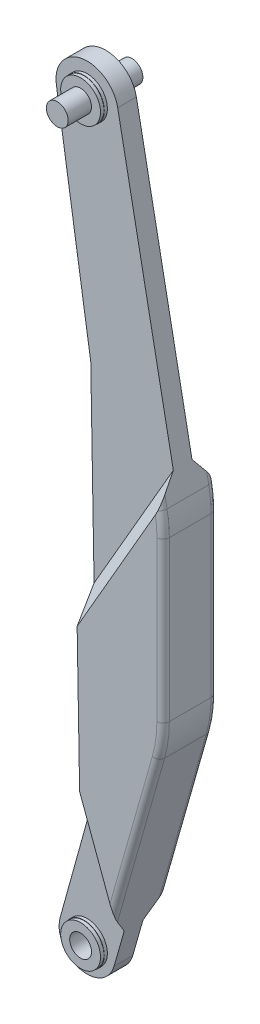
ISO-10303-21;
HEADER;
FILE_DESCRIPTION(('STEP AP214'),'2;1');
FILE_NAME('part.step','',(''),(''),'','','');
FILE_SCHEMA(('AUTOMOTIVE_DESIGN { 1 0 10303 214 1 1 1 1 }'));
ENDSEC;
DATA;
#1=APPLICATION_CONTEXT('core data for automotive mechanical design processes');
#2=APPLICATION_PROTOCOL_DEFINITION('international standard','automotive_design',2000,#1);
#3=PRODUCT_CONTEXT('',#1,'mechanical');
#4=PRODUCT('Part','Part','',(#3));
#5=PRODUCT_RELATED_PRODUCT_CATEGORY('part','',(#4));
#6=PRODUCT_DEFINITION_FORMATION('','',#4);
#7=PRODUCT_DEFINITION_CONTEXT('part definition',#1,'design');
#8=PRODUCT_DEFINITION('design','',#6,#7);
#9=PRODUCT_DEFINITION_SHAPE('','',#8);
#10=(LENGTH_UNIT() NAMED_UNIT(*) SI_UNIT(.MILLI.,.METRE.));
#11=(NAMED_UNIT(*) PLANE_ANGLE_UNIT() SI_UNIT($,.RADIAN.));
#12=(NAMED_UNIT(*) SI_UNIT($,.STERADIAN.) SOLID_ANGLE_UNIT());
#13=UNCERTAINTY_MEASURE_WITH_UNIT(LENGTH_MEASURE(1.E-05),#10,'distance_accuracy_value','');
#14=(GEOMETRIC_REPRESENTATION_CONTEXT(3) GLOBAL_UNCERTAINTY_ASSIGNED_CONTEXT((#13)) GLOBAL_UNIT_ASSIGNED_CONTEXT((#10,
#11,#12)) REPRESENTATION_CONTEXT('',''));
#15=CARTESIAN_POINT('',(0.,0.,0.));
#16=DIRECTION('',(0.,0.,1.));
#17=DIRECTION('',(1.,0.,0.));
#18=AXIS2_PLACEMENT_3D('',#15,#16,#17);
#19=CARTESIAN_POINT('',(0.,1175.,-5.));
#20=DIRECTION('',(0.,0.,1.));
#21=DIRECTION('',(1.,0.,0.));
#22=AXIS2_PLACEMENT_3D('',#19,#20,#21);
#23=PLANE('',#22);
#24=CARTESIAN_POINT('',(0.,1175.,-5.));
#25=DIRECTION('',(0.,0.,1.));
#26=DIRECTION('',(1.,0.,0.));
#27=AXIS2_PLACEMENT_3D('',#24,#25,#26);
#28=CIRCLE('',#27,32.5);
#29=CARTESIAN_POINT('',(32.5,1175.,-5.));
#30=VERTEX_POINT('',#29);
#31=EDGE_CURVE('E354',#30,#30,#28,.T.);
#32=ORIENTED_EDGE('',*,*,#31,.F.);
#33=EDGE_LOOP('',(#32));
#34=FACE_BOUND('',#33,.T.);
#35=CARTESIAN_POINT('',(0.,1175.,-5.));
#36=DIRECTION('',(0.,0.,1.));
#37=DIRECTION('',(1.,0.,0.));
#38=AXIS2_PLACEMENT_3D('',#35,#36,#37);
#39=CIRCLE('',#38,32.);
#40=CARTESIAN_POINT('',(32.,1175.,-5.));
#41=VERTEX_POINT('',#40);
#42=EDGE_CURVE('E11',#41,#41,#39,.F.);
#43=ORIENTED_EDGE('',*,*,#42,.F.);
#44=EDGE_LOOP('',(#43));
#45=FACE_BOUND('',#44,.T.);
#46=ADVANCED_FACE('F16',(#34,#45),#23,.F.);
#47=CARTESIAN_POINT('',(0.,1175.,35.));
#48=DIRECTION('',(0.,0.,1.));
#49=DIRECTION('',(1.,0.,0.));
#50=AXIS2_PLACEMENT_3D('',#47,#48,#49);
#51=PLANE('',#50);
#52=CARTESIAN_POINT('',(0.,1175.,35.));
#53=DIRECTION('',(0.,0.,1.));
#54=DIRECTION('',(1.,0.,0.));
#55=AXIS2_PLACEMENT_3D('',#52,#53,#54);
#56=CIRCLE('',#55,32.5);
#57=CARTESIAN_POINT('',(32.5,1175.,35.));
#58=VERTEX_POINT('',#57);
#59=EDGE_CURVE('E357',#58,#58,#56,.T.);
#60=ORIENTED_EDGE('',*,*,#59,.T.);
#61=EDGE_LOOP('',(#60));
#62=FACE_BOUND('',#61,.T.);
#63=CARTESIAN_POINT('',(0.,1175.,35.));
#64=DIRECTION('',(0.,0.,1.));
#65=DIRECTION('',(1.,0.,0.));
#66=AXIS2_PLACEMENT_3D('',#63,#64,#65);
#67=CIRCLE('',#66,32.);
#68=CARTESIAN_POINT('',(32.,1175.,35.));
#69=VERTEX_POINT('',#68);
#70=EDGE_CURVE('E20',#69,#69,#67,.F.);
#71=ORIENTED_EDGE('',*,*,#70,.T.);
#72=EDGE_LOOP('',(#71));
#73=FACE_BOUND('',#72,.T.);
#74=ADVANCED_FACE('F540',(#62,#73),#51,.T.);
#75=CARTESIAN_POINT('',(30.4828677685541,252.56993183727,39.));
#76=DIRECTION('',(-0.994521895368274,-0.104528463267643,0.));
#77=DIRECTION('',(0.104528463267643,-0.994521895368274,0.));
#78=AXIS2_PLACEMENT_3D('',#75,#76,#77);
#79=PLANE('',#78);
#80=DIRECTION('',(-0.104528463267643,0.994521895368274,0.));
#81=VECTOR('',#80,1.);
#82=CARTESIAN_POINT('',(30.4828677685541,252.56993183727,-29.));
#83=LINE('',#82,#81);
#84=CARTESIAN_POINT('',(30.4828677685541,252.56993183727,-29.));
#85=VERTEX_POINT('',#84);
#86=CARTESIAN_POINT('',(12.5613807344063,423.081491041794,-29.));
#87=VERTEX_POINT('',#86);
#88=EDGE_CURVE('E303',#85,#87,#83,.T.);
#89=ORIENTED_EDGE('',*,*,#88,.F.);
#90=DIRECTION('',(0.,0.,-1.));
#91=VECTOR('',#90,1.);
#92=CARTESIAN_POINT('',(30.4828677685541,252.56993183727,39.));
#93=LINE('',#92,#91);
#94=CARTESIAN_POINT('',(30.4828677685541,252.56993183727,39.));
#95=VERTEX_POINT('',#94);
#96=EDGE_CURVE('E317',#95,#85,#93,.T.);
#97=ORIENTED_EDGE('',*,*,#96,.F.);
#98=DIRECTION('',(-0.104528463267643,0.994521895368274,0.));
#99=VECTOR('',#98,1.);
#100=CARTESIAN_POINT('',(30.4828677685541,252.56993183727,39.));
#101=LINE('',#100,#99);
#102=CARTESIAN_POINT('',(12.5613807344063,423.081491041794,39.));
#103=VERTEX_POINT('',#102);
#104=EDGE_CURVE('E309',#95,#103,#101,.T.);
#105=ORIENTED_EDGE('',*,*,#104,.T.);
#106=DIRECTION('',(0.,0.,-1.));
#107=VECTOR('',#106,1.);
#108=CARTESIAN_POINT('',(12.5613807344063,423.081491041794,39.));
#109=LINE('',#108,#107);
#110=EDGE_CURVE('E323',#103,#87,#109,.T.);
#111=ORIENTED_EDGE('',*,*,#110,.T.);
#112=EDGE_LOOP('',(#89,#97,#105,#111));
#113=FACE_BOUND('',#112,.T.);
#114=DIRECTION('',(0.,0.,1.));
#115=VECTOR('',#114,1.);
#116=CARTESIAN_POINT('',(29.751168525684,259.531585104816,33.));
#117=LINE('',#116,#115);
#118=CARTESIAN_POINT('',(29.751168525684,259.531585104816,-6.99999999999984));
#119=VERTEX_POINT('',#118);
#120=CARTESIAN_POINT('',(29.751168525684,259.531585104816,33.));
#121=VERTEX_POINT('',#120);
#122=EDGE_CURVE('E230',#119,#121,#117,.T.);
#123=ORIENTED_EDGE('',*,*,#122,.F.);
#124=DIRECTION('',(0.104528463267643,-0.994521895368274,0.));
#125=VECTOR('',#124,1.);
#126=CARTESIAN_POINT('',(29.751168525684,259.531585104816,-6.99999999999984));
#127=LINE('',#126,#125);
#128=CARTESIAN_POINT('',(19.2983221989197,358.983774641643,-6.99999999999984));
#129=VERTEX_POINT('',#128);
#130=EDGE_CURVE('E241',#129,#119,#127,.T.);
#131=ORIENTED_EDGE('',*,*,#130,.F.);
#132=DIRECTION('',(0.,0.,-1.));
#133=VECTOR('',#132,1.);
#134=CARTESIAN_POINT('',(19.2983221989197,358.983774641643,-6.99999999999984));
#135=LINE('',#134,#133);
#136=CARTESIAN_POINT('',(19.2983221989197,358.983774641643,33.));
#137=VERTEX_POINT('',#136);
#138=EDGE_CURVE('E252',#137,#129,#135,.T.);
#139=ORIENTED_EDGE('',*,*,#138,.F.);
#140=DIRECTION('',(-0.104528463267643,0.994521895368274,0.));
#141=VECTOR('',#140,1.);
#142=CARTESIAN_POINT('',(19.2983221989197,358.983774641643,33.));
#143=LINE('',#142,#141);
#144=EDGE_CURVE('E250',#121,#137,#143,.T.);
#145=ORIENTED_EDGE('',*,*,#144,.F.);
#146=EDGE_LOOP('',(#123,#131,#139,#145));
#147=FACE_BOUND('',#146,.T.);
#148=ADVANCED_FACE('F249',(#113,#147),#79,.T.);
#149=CARTESIAN_POINT('',(5.81730696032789,809.449218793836,30.));
#150=DIRECTION('',(0.999847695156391,0.0174524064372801,0.));
#151=DIRECTION('',(-0.0174524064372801,0.999847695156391,0.));
#152=AXIS2_PLACEMENT_3D('',#149,#150,#151);
#153=PLANE('',#152);
#154=ORIENTED_EDGE('',*,*,#110,.F.);
#155=DIRECTION('',(0.01745240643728,-0.999847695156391,0.));
#156=VECTOR('',#155,1.);
#157=CARTESIAN_POINT('',(12.5613807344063,423.081491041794,39.));
#158=LINE('',#157,#156);
#159=CARTESIAN_POINT('',(15.8713759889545,233.451989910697,39.));
#160=VERTEX_POINT('',#159);
#161=EDGE_CURVE('E312',#103,#160,#158,.T.);
#162=ORIENTED_EDGE('',*,*,#161,.T.);
#163=DIRECTION('',(0.,0.,-1.));
#164=VECTOR('',#163,1.);
#165=CARTESIAN_POINT('',(15.8713759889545,233.451989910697,39.));
#166=LINE('',#165,#164);
#167=CARTESIAN_POINT('',(15.8713759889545,233.451989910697,-29.));
#168=VERTEX_POINT('',#167);
#169=EDGE_CURVE('E320',#160,#168,#166,.T.);
#170=ORIENTED_EDGE('',*,*,#169,.T.);
#171=DIRECTION('',(0.0162390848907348,-0.930336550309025,0.366347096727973));
#172=VECTOR('',#171,1.);
#173=CARTESIAN_POINT('',(18.9025316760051,59.7971969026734,39.3816294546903));
#174=LINE('',#173,#172);
#175=CARTESIAN_POINT('',(15.8987808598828,231.881965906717,-28.381757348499));
#176=VERTEX_POINT('',#175);
#177=EDGE_CURVE('E352',#168,#176,#174,.T.);
#178=ORIENTED_EDGE('',*,*,#177,.T.);
#179=DIRECTION('',(0.,0.,-1.));
#180=VECTOR('',#179,1.);
#181=CARTESIAN_POINT('',(15.8987808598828,231.881965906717,56.0982950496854));
#182=LINE('',#181,#180);
#183=CARTESIAN_POINT('',(15.8987808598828,231.881965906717,58.));
#184=VERTEX_POINT('',#183);
#185=EDGE_CURVE('E449',#176,#184,#182,.F.);
#186=ORIENTED_EDGE('',*,*,#185,.T.);
#187=DIRECTION('',(0.0174524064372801,-0.999847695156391,0.));
#188=VECTOR('',#187,1.);
#189=CARTESIAN_POINT('',(11.1390715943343,504.565527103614,58.));
#190=LINE('',#189,#188);
#191=CARTESIAN_POINT('',(11.9352081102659,458.95489665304,58.));
#192=VERTEX_POINT('',#191);
#193=EDGE_CURVE('E325',#192,#184,#190,.T.);
#194=ORIENTED_EDGE('',*,*,#193,.F.);
#195=DIRECTION('',(0.0148740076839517,-0.852131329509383,0.523116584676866));
#196=VECTOR('',#195,1.);
#197=CARTESIAN_POINT('',(12.8141297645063,408.601508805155,88.9115407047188));
#198=LINE('',#197,#196);
#199=CARTESIAN_POINT('',(11.1390715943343,504.565527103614,30.));
#200=VERTEX_POINT('',#199);
#201=EDGE_CURVE('E436',#192,#200,#198,.F.);
#202=ORIENTED_EDGE('',*,*,#201,.T.);
#203=DIRECTION('',(0.0174524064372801,-0.999847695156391,0.));
#204=VECTOR('',#203,1.);
#205=CARTESIAN_POINT('',(5.81730696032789,809.449218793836,30.));
#206=LINE('',#205,#204);
#207=CARTESIAN_POINT('',(5.81730696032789,809.449218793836,30.));
#208=VERTEX_POINT('',#207);
#209=EDGE_CURVE('E386',#208,#200,#206,.T.);
#210=ORIENTED_EDGE('',*,*,#209,.F.);
#211=DIRECTION('',(0.,0.,-1.));
#212=VECTOR('',#211,1.);
#213=CARTESIAN_POINT('',(5.81730696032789,809.449218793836,30.));
#214=LINE('',#213,#212);
#215=CARTESIAN_POINT('',(5.81730696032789,809.449218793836,0.));
#216=VERTEX_POINT('',#215);
#217=EDGE_CURVE('E407',#208,#216,#214,.T.);
#218=ORIENTED_EDGE('',*,*,#217,.T.);
#219=DIRECTION('',(0.0174524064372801,-0.999847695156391,0.));
#220=VECTOR('',#219,1.);
#221=CARTESIAN_POINT('',(5.81730696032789,809.449218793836,0.));
#222=LINE('',#221,#220);
#223=CARTESIAN_POINT('',(11.1390715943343,504.565527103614,0.));
#224=VERTEX_POINT('',#223);
#225=EDGE_CURVE('E369',#216,#224,#222,.T.);
#226=ORIENTED_EDGE('',*,*,#225,.T.);
#227=DIRECTION('',(0.0148740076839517,-0.852131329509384,-0.523116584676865));
#228=VECTOR('',#227,1.);
#229=CARTESIAN_POINT('',(8.37330732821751,663.016055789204,97.2715079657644));
#230=LINE('',#229,#228);
#231=CARTESIAN_POINT('',(11.9636415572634,457.32594556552,-29.));
#232=VERTEX_POINT('',#231);
#233=EDGE_CURVE('E418',#224,#232,#230,.T.);
#234=ORIENTED_EDGE('',*,*,#233,.T.);
#235=DIRECTION('',(0.0174524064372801,-0.999847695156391,0.));
#236=VECTOR('',#235,1.);
#237=CARTESIAN_POINT('',(11.1390715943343,504.565527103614,-29.));
#238=LINE('',#237,#236);
#239=EDGE_CURVE('E328',#232,#87,#238,.T.);
#240=ORIENTED_EDGE('',*,*,#239,.T.);
#241=EDGE_LOOP('',(#154,#162,#170,#178,#186,#194,#202,#210,#218,#226,#234,#240));
#242=FACE_BOUND('',#241,.T.);
#243=ADVANCED_FACE('F539',(#242),#153,.F.);
#244=CARTESIAN_POINT('',(-225.901766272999,502.868766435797,-29.));
#245=DIRECTION('',(0.,0.,1.));
#246=DIRECTION('',(1.,0.,0.));
#247=AXIS2_PLACEMENT_3D('',#244,#245,#246);
#248=PLANE('',#247);
#249=CARTESIAN_POINT('',(-50.,390.328268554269,-29.));
#250=DIRECTION('',(0.,0.,1.));
#251=DIRECTION('',(1.,0.,0.));
#252=AXIS2_PLACEMENT_3D('',#249,#250,#251);
#253=CIRCLE('',#252,190.);
#254=CARTESIAN_POINT('',(140.,390.328268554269,-29.));
#255=VERTEX_POINT('',#254);
#256=CARTESIAN_POINT('',(132.733883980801,338.286673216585,-29.));
#257=VERTEX_POINT('',#256);
#258=EDGE_CURVE('E479',#255,#257,#253,.F.);
#259=ORIENTED_EDGE('',*,*,#258,.T.);
#260=DIRECTION('',(0.27390313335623,0.961757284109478,0.));
#261=VECTOR('',#260,1.);
#262=CARTESIAN_POINT('',(149.183574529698,396.046544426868,-29.));
#263=LINE('',#262,#261);
#264=CARTESIAN_POINT('',(65.0201133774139,100.523010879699,-29.));
#265=VERTEX_POINT('',#264);
#266=EDGE_CURVE('E481',#257,#265,#263,.F.);
#267=ORIENTED_EDGE('',*,*,#266,.T.);
#268=DIRECTION('',(-0.346791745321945,0.937942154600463,0.));
#269=VECTOR('',#268,1.);
#270=CARTESIAN_POINT('',(28.8170443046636,198.438791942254,-29.));
#271=LINE('',#270,#269);
#272=EDGE_CURVE('E420',#265,#168,#271,.T.);
#273=ORIENTED_EDGE('',*,*,#272,.T.);
#274=DIRECTION('',(0.607237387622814,0.794520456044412,0.));
#275=VECTOR('',#274,1.);
#276=CARTESIAN_POINT('',(30.4828677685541,252.56993183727,-29.));
#277=LINE('',#276,#275);
#278=EDGE_CURVE('E306',#168,#85,#277,.T.);
#279=ORIENTED_EDGE('',*,*,#278,.T.);
#280=ORIENTED_EDGE('',*,*,#88,.T.);
#281=ORIENTED_EDGE('',*,*,#239,.F.);
#282=DIRECTION('',(0.5,0.866025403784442,0.));
#283=VECTOR('',#282,1.);
#284=CARTESIAN_POINT('',(159.480740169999,712.83305534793,-29.));
#285=LINE('',#284,#283);
#286=CARTESIAN_POINT('',(137.757412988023,675.207148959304,-29.));
#287=VERTEX_POINT('',#286);
#288=EDGE_CURVE('E422',#232,#287,#285,.T.);
#289=ORIENTED_EDGE('',*,*,#288,.T.);
#290=CARTESIAN_POINT('',(-50.,646.101241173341,-29.));
#291=DIRECTION('',(0.,0.,1.));
#292=DIRECTION('',(1.,0.,0.));
#293=AXIS2_PLACEMENT_3D('',#290,#291,#292);
#294=CIRCLE('',#293,190.);
#295=CARTESIAN_POINT('',(140.,646.101241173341,-29.));
#296=VERTEX_POINT('',#295);
#297=EDGE_CURVE('E475',#287,#296,#294,.F.);
#298=ORIENTED_EDGE('',*,*,#297,.T.);
#299=DIRECTION('',(0.,-1.,0.));
#300=VECTOR('',#299,1.);
#301=CARTESIAN_POINT('',(140.,502.868766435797,-29.));
#302=LINE('',#301,#300);
#303=EDGE_CURVE('E477',#296,#255,#302,.T.);
#304=ORIENTED_EDGE('',*,*,#303,.T.);
#305=EDGE_LOOP('',(#259,#267,#273,#279,#280,#281,#289,#298,#304));
#306=FACE_BOUND('',#305,.T.);
#307=ADVANCED_FACE('F646',(#306),#248,.F.);
#308=CARTESIAN_POINT('',(0.,1175.,30.));
#309=DIRECTION('',(0.,0.,-1.));
#310=DIRECTION('',(-1.,0.,0.));
#311=AXIS2_PLACEMENT_3D('',#308,#309,#310);
#312=PLANE('',#311);
#313=CARTESIAN_POINT('',(0.,0.,30.));
#314=DIRECTION('',(0.,0.,-1.));
#315=DIRECTION('',(-1.,0.,0.));
#316=AXIS2_PLACEMENT_3D('',#313,#314,#315);
#317=CIRCLE('',#316,32.5);
#318=CARTESIAN_POINT('',(-32.5,0.,30.));
#319=VERTEX_POINT('',#318);
#320=EDGE_CURVE('E349',#319,#319,#317,.F.);
#321=ORIENTED_EDGE('',*,*,#320,.F.);
#322=EDGE_LOOP('',(#321));
#323=FACE_BOUND('',#322,.T.);
#324=DIRECTION('',(0.27390313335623,0.961757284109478,0.));
#325=VECTOR('',#324,1.);
#326=CARTESIAN_POINT('',(185.,485.299660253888,30.));
#327=LINE('',#326,#325);
#328=CARTESIAN_POINT('',(43.2790777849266,-12.3256410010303,30.));
#329=VERTEX_POINT('',#328);
#330=CARTESIAN_POINT('',(59.6051019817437,45.,30.));
#331=VERTEX_POINT('',#330);
#332=EDGE_CURVE('E393',#329,#331,#327,.T.);
#333=ORIENTED_EDGE('',*,*,#332,.T.);
#334=DIRECTION('',(-0.346791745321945,0.937942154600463,0.));
#335=VECTOR('',#334,1.);
#336=CARTESIAN_POINT('',(-315.11905106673,1058.48888556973,30.));
#337=LINE('',#336,#335);
#338=CARTESIAN_POINT('',(5.99326374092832,190.,30.));
#339=VERTEX_POINT('',#338);
#340=EDGE_CURVE('E340',#331,#339,#337,.T.);
#341=ORIENTED_EDGE('',*,*,#340,.T.);
#342=DIRECTION('',(-0.267238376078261,-0.963630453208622,0.));
#343=VECTOR('',#342,1.);
#344=CARTESIAN_POINT('',(16.,226.083125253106,30.));
#345=LINE('',#344,#343);
#346=CARTESIAN_POINT('',(-43.363370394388,12.0257269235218,30.));
#347=VERTEX_POINT('',#346);
#348=EDGE_CURVE('E389',#339,#347,#345,.T.);
#349=ORIENTED_EDGE('',*,*,#348,.T.);
#350=CARTESIAN_POINT('',(0.,0.,30.));
#351=DIRECTION('',(0.,0.,1.));
#352=DIRECTION('',(1.,0.,0.));
#353=AXIS2_PLACEMENT_3D('',#350,#351,#352);
#354=CIRCLE('',#353,45.);
#355=EDGE_CURVE('E391',#347,#329,#354,.T.);
#356=ORIENTED_EDGE('',*,*,#355,.T.);
#357=EDGE_LOOP('',(#333,#341,#349,#356));
#358=FACE_BOUND('',#357,.T.);
#359=ADVANCED_FACE('F628',(#323,#358),#312,.F.);
#360=CARTESIAN_POINT('',(0.,1175.,0.));
#361=DIRECTION('',(0.,0.,-1.));
#362=DIRECTION('',(-1.,0.,0.));
#363=AXIS2_PLACEMENT_3D('',#360,#361,#362);
#364=PLANE('',#363);
#365=DIRECTION('',(-0.346791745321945,0.937942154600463,0.));
#366=VECTOR('',#365,1.);
#367=CARTESIAN_POINT('',(-315.11905106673,1058.48888556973,0.));
#368=LINE('',#367,#366);
#369=CARTESIAN_POINT('',(59.6051019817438,45.,0.));
#370=VERTEX_POINT('',#369);
#371=CARTESIAN_POINT('',(5.99326374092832,190.,0.));
#372=VERTEX_POINT('',#371);
#373=EDGE_CURVE('E337',#370,#372,#368,.T.);
#374=ORIENTED_EDGE('',*,*,#373,.F.);
#375=DIRECTION('',(0.27390313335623,0.961757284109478,0.));
#376=VECTOR('',#375,1.);
#377=CARTESIAN_POINT('',(185.,485.299660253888,0.));
#378=LINE('',#377,#376);
#379=CARTESIAN_POINT('',(43.2790777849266,-12.3256410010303,0.));
#380=VERTEX_POINT('',#379);
#381=EDGE_CURVE('E376',#380,#370,#378,.T.);
#382=ORIENTED_EDGE('',*,*,#381,.F.);
#383=CARTESIAN_POINT('',(0.,0.,0.));
#384=DIRECTION('',(0.,0.,1.));
#385=DIRECTION('',(1.,0.,0.));
#386=AXIS2_PLACEMENT_3D('',#383,#384,#385);
#387=CIRCLE('',#386,45.);
#388=CARTESIAN_POINT('',(-43.363370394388,12.0257269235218,0.));
#389=VERTEX_POINT('',#388);
#390=EDGE_CURVE('E374',#389,#380,#387,.T.);
#391=ORIENTED_EDGE('',*,*,#390,.F.);
#392=DIRECTION('',(-0.267238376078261,-0.963630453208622,0.));
#393=VECTOR('',#392,1.);
#394=CARTESIAN_POINT('',(16.,226.083125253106,0.));
#395=LINE('',#394,#393);
#396=EDGE_CURVE('E372',#372,#389,#395,.T.);
#397=ORIENTED_EDGE('',*,*,#396,.F.);
#398=EDGE_LOOP('',(#374,#382,#391,#397));
#399=FACE_BOUND('',#398,.T.);
#400=CARTESIAN_POINT('',(0.,0.,0.));
#401=DIRECTION('',(0.,0.,-1.));
#402=DIRECTION('',(-1.,0.,0.));
#403=AXIS2_PLACEMENT_3D('',#400,#401,#402);
#404=CIRCLE('',#403,32.5);
#405=CARTESIAN_POINT('',(-32.5,0.,0.));
#406=VERTEX_POINT('',#405);
#407=EDGE_CURVE('E348',#406,#406,#404,.F.);
#408=ORIENTED_EDGE('',*,*,#407,.T.);
#409=EDGE_LOOP('',(#408));
#410=FACE_BOUND('',#409,.T.);
#411=ADVANCED_FACE('F624',(#399,#410),#364,.T.);
#412=CARTESIAN_POINT('',(0.,1175.,30.));
#413=DIRECTION('',(0.,0.,-1.));
#414=DIRECTION('',(-1.,0.,0.));
#415=AXIS2_PLACEMENT_3D('',#412,#413,#414);
#416=CIRCLE('',#415,32.5);
#417=CARTESIAN_POINT('',(-32.5,1175.,30.));
#418=VERTEX_POINT('',#417);
#419=EDGE_CURVE('E353',#418,#418,#416,.F.);
#420=ORIENTED_EDGE('',*,*,#419,.F.);
#421=EDGE_LOOP('',(#420));
#422=FACE_BOUND('',#421,.T.);
#423=ORIENTED_EDGE('',*,*,#209,.T.);
#424=DIRECTION('',(0.5,0.866025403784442,0.));
#425=VECTOR('',#424,1.);
#426=CARTESIAN_POINT('',(298.660946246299,1002.56802228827,30.));
#427=LINE('',#426,#425);
#428=CARTESIAN_POINT('',(138.406973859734,725.,30.));
#429=VERTEX_POINT('',#428);
#430=EDGE_CURVE('E334',#200,#429,#427,.T.);
#431=ORIENTED_EDGE('',*,*,#430,.T.);
#432=DIRECTION('',(-0.190808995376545,0.981627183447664,0.));
#433=VECTOR('',#432,1.);
#434=CARTESIAN_POINT('',(49.0813591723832,1184.54044976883,30.));
#435=LINE('',#434,#433);
#436=CARTESIAN_POINT('',(49.0813591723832,1184.54044976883,30.));
#437=VERTEX_POINT('',#436);
#438=EDGE_CURVE('E396',#429,#437,#435,.T.);
#439=ORIENTED_EDGE('',*,*,#438,.T.);
#440=CARTESIAN_POINT('',(0.,1175.,30.));
#441=DIRECTION('',(0.,0.,1.));
#442=DIRECTION('',(-1.,0.,0.));
#443=AXIS2_PLACEMENT_3D('',#440,#441,#442);
#444=CIRCLE('',#443,50.);
#445=CARTESIAN_POINT('',(-49.4151151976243,1167.37462197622,30.));
#446=VERTEX_POINT('',#445);
#447=EDGE_CURVE('E381',#437,#446,#444,.T.);
#448=ORIENTED_EDGE('',*,*,#447,.T.);
#449=DIRECTION('',(0.15250756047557,-0.988302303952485,0.));
#450=VECTOR('',#449,1.);
#451=CARTESIAN_POINT('',(-49.4151151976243,1167.37462197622,30.));
#452=LINE('',#451,#450);
#453=EDGE_CURVE('E384',#446,#208,#452,.T.);
#454=ORIENTED_EDGE('',*,*,#453,.T.);
#455=EDGE_LOOP('',(#423,#431,#439,#448,#454));
#456=FACE_BOUND('',#455,.T.);
#457=ADVANCED_FACE('F622',(#422,#456),#312,.F.);
#458=DIRECTION('',(0.5,0.866025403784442,0.));
#459=VECTOR('',#458,1.);
#460=CARTESIAN_POINT('',(298.660946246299,1002.56802228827,0.));
#461=LINE('',#460,#459);
#462=CARTESIAN_POINT('',(138.406973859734,725.,0.));
#463=VERTEX_POINT('',#462);
#464=EDGE_CURVE('E331',#224,#463,#461,.T.);
#465=ORIENTED_EDGE('',*,*,#464,.F.);
#466=ORIENTED_EDGE('',*,*,#225,.F.);
#467=DIRECTION('',(0.15250756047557,-0.988302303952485,0.));
#468=VECTOR('',#467,1.);
#469=CARTESIAN_POINT('',(-49.4151151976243,1167.37462197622,0.));
#470=LINE('',#469,#468);
#471=CARTESIAN_POINT('',(-49.4151151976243,1167.37462197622,0.));
#472=VERTEX_POINT('',#471);
#473=EDGE_CURVE('E367',#472,#216,#470,.T.);
#474=ORIENTED_EDGE('',*,*,#473,.F.);
#475=CARTESIAN_POINT('',(0.,1175.,0.));
#476=DIRECTION('',(0.,0.,1.));
#477=DIRECTION('',(-1.,0.,0.));
#478=AXIS2_PLACEMENT_3D('',#475,#476,#477);
#479=CIRCLE('',#478,50.);
#480=CARTESIAN_POINT('',(49.0813591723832,1184.54044976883,0.));
#481=VERTEX_POINT('',#480);
#482=EDGE_CURVE('E364',#481,#472,#479,.T.);
#483=ORIENTED_EDGE('',*,*,#482,.F.);
#484=DIRECTION('',(-0.190808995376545,0.981627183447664,0.));
#485=VECTOR('',#484,1.);
#486=CARTESIAN_POINT('',(49.0813591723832,1184.54044976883,0.));
#487=LINE('',#486,#485);
#488=EDGE_CURVE('E379',#463,#481,#487,.T.);
#489=ORIENTED_EDGE('',*,*,#488,.F.);
#490=EDGE_LOOP('',(#465,#466,#474,#483,#489));
#491=FACE_BOUND('',#490,.T.);
#492=CARTESIAN_POINT('',(0.,1175.,0.));
#493=DIRECTION('',(0.,0.,-1.));
#494=DIRECTION('',(-1.,0.,0.));
#495=AXIS2_PLACEMENT_3D('',#492,#493,#494);
#496=CIRCLE('',#495,32.5);
#497=CARTESIAN_POINT('',(-32.5,1175.,0.));
#498=VERTEX_POINT('',#497);
#499=EDGE_CURVE('E360',#498,#498,#496,.F.);
#500=ORIENTED_EDGE('',*,*,#499,.T.);
#501=EDGE_LOOP('',(#500));
#502=FACE_BOUND('',#501,.T.);
#503=ADVANCED_FACE('F619',(#491,#502),#364,.T.);
#504=CARTESIAN_POINT('',(0.,1175.,30.));
#505=DIRECTION('',(0.,0.,-1.));
#506=DIRECTION('',(-1.,0.,0.));
#507=AXIS2_PLACEMENT_3D('',#504,#505,#506);
#508=CYLINDRICAL_SURFACE('',#507,50.);
#509=ORIENTED_EDGE('',*,*,#482,.T.);
#510=DIRECTION('',(0.,0.,-1.));
#511=VECTOR('',#510,1.);
#512=CARTESIAN_POINT('',(-49.4151151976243,1167.37462197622,30.));
#513=LINE('',#512,#511);
#514=EDGE_CURVE('E363',#446,#472,#513,.T.);
#515=ORIENTED_EDGE('',*,*,#514,.F.);
#516=ORIENTED_EDGE('',*,*,#447,.F.);
#517=DIRECTION('',(0.,0.,-1.));
#518=VECTOR('',#517,1.);
#519=CARTESIAN_POINT('',(49.0813591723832,1184.54044976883,30.));
#520=LINE('',#519,#518);
#521=EDGE_CURVE('E398',#437,#481,#520,.T.);
#522=ORIENTED_EDGE('',*,*,#521,.T.);
#523=EDGE_LOOP('',(#509,#515,#516,#522));
#524=FACE_BOUND('',#523,.T.);
#525=ADVANCED_FACE('F18',(#524),#508,.T.);
#526=CARTESIAN_POINT('',(-49.4151151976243,1167.37462197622,30.));
#527=DIRECTION('',(0.988302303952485,0.15250756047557,0.));
#528=DIRECTION('',(-0.15250756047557,0.988302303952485,0.));
#529=AXIS2_PLACEMENT_3D('',#526,#527,#528);
#530=PLANE('',#529);
#531=ORIENTED_EDGE('',*,*,#473,.T.);
#532=ORIENTED_EDGE('',*,*,#217,.F.);
#533=ORIENTED_EDGE('',*,*,#453,.F.);
#534=ORIENTED_EDGE('',*,*,#514,.T.);
#535=EDGE_LOOP('',(#531,#532,#533,#534));
#536=FACE_BOUND('',#535,.T.);
#537=ADVANCED_FACE('F643',(#536),#530,.F.);
#538=CARTESIAN_POINT('',(16.,226.083125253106,30.));
#539=DIRECTION('',(0.963630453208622,-0.267238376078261,0.));
#540=DIRECTION('',(0.267238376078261,0.963630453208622,0.));
#541=AXIS2_PLACEMENT_3D('',#538,#539,#540);
#542=PLANE('',#541);
#543=DIRECTION('',(-0.219241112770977,-0.790557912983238,-0.571796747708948));
#544=VECTOR('',#543,1.);
#545=CARTESIAN_POINT('',(66.5218673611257,408.25909360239,187.86299501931));
#546=LINE('',#545,#544);
#547=CARTESIAN_POINT('',(14.450091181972,220.494334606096,52.0560202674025));
#548=VERTEX_POINT('',#547);
#549=EDGE_CURVE('E443',#339,#548,#546,.F.);
#550=ORIENTED_EDGE('',*,*,#549,.T.);
#551=DIRECTION('',(0.,0.,-1.));
#552=VECTOR('',#551,1.);
#553=CARTESIAN_POINT('',(14.450091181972,220.494334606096,-26.0982950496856));
#554=LINE('',#553,#552);
#555=CARTESIAN_POINT('',(14.450091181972,220.494334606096,-22.0560202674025));
#556=VERTEX_POINT('',#555);
#557=EDGE_CURVE('E446',#548,#556,#554,.T.);
#558=ORIENTED_EDGE('',*,*,#557,.T.);
#559=DIRECTION('',(-0.219241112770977,-0.790557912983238,0.571796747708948));
#560=VECTOR('',#559,1.);
#561=CARTESIAN_POINT('',(-16.5615994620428,108.66979073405,58.8247216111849));
#562=LINE('',#561,#560);
#563=EDGE_CURVE('E430',#556,#372,#562,.T.);
#564=ORIENTED_EDGE('',*,*,#563,.T.);
#565=ORIENTED_EDGE('',*,*,#396,.T.);
#566=DIRECTION('',(0.,0.,-1.));
#567=VECTOR('',#566,1.);
#568=CARTESIAN_POINT('',(-43.363370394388,12.0257269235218,30.));
#569=LINE('',#568,#567);
#570=EDGE_CURVE('E404',#347,#389,#569,.T.);
#571=ORIENTED_EDGE('',*,*,#570,.F.);
#572=ORIENTED_EDGE('',*,*,#348,.F.);
#573=EDGE_LOOP('',(#550,#558,#564,#565,#571,#572));
#574=FACE_BOUND('',#573,.T.);
#575=ADVANCED_FACE('F639',(#574),#542,.F.);
#576=CARTESIAN_POINT('',(0.,0.,30.));
#577=DIRECTION('',(0.,0.,-1.));
#578=DIRECTION('',(-1.,0.,0.));
#579=AXIS2_PLACEMENT_3D('',#576,#577,#578);
#580=CYLINDRICAL_SURFACE('',#579,45.);
#581=ORIENTED_EDGE('',*,*,#390,.T.);
#582=DIRECTION('',(0.,0.,-1.));
#583=VECTOR('',#582,1.);
#584=CARTESIAN_POINT('',(43.2790777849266,-12.3256410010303,30.));
#585=LINE('',#584,#583);
#586=EDGE_CURVE('E401',#329,#380,#585,.T.);
#587=ORIENTED_EDGE('',*,*,#586,.F.);
#588=ORIENTED_EDGE('',*,*,#355,.F.);
#589=ORIENTED_EDGE('',*,*,#570,.T.);
#590=EDGE_LOOP('',(#581,#587,#588,#589));
#591=FACE_BOUND('',#590,.T.);
#592=ADVANCED_FACE('F635',(#591),#580,.T.);
#593=CARTESIAN_POINT('',(185.,485.299660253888,30.));
#594=DIRECTION('',(-0.961757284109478,0.27390313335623,0.));
#595=DIRECTION('',(-0.27390313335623,-0.961757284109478,0.));
#596=AXIS2_PLACEMENT_3D('',#593,#594,#595);
#597=PLANE('',#596);
#598=DIRECTION('',(0.224005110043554,0.786550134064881,-0.57546554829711));
#599=VECTOR('',#598,1.);
#600=CARTESIAN_POINT('',(59.6051019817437,45.,1.38777878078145E-13));
#601=LINE('',#600,#599);
#602=CARTESIAN_POINT('',(67.0010218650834,70.9693262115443,-19.));
#603=VERTEX_POINT('',#602);
#604=EDGE_CURVE('E427',#370,#603,#601,.T.);
#605=ORIENTED_EDGE('',*,*,#604,.T.);
#606=DIRECTION('',(0.27390313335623,0.961757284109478,0.));
#607=VECTOR('',#606,1.);
#608=CARTESIAN_POINT('',(185.,485.299660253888,-19.));
#609=LINE('',#608,#607);
#610=CARTESIAN_POINT('',(142.351456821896,335.547641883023,-19.));
#611=VERTEX_POINT('',#610);
#612=EDGE_CURVE('E472',#603,#611,#609,.T.);
#613=ORIENTED_EDGE('',*,*,#612,.T.);
#614=DIRECTION('',(0.,0.,1.));
#615=VECTOR('',#614,1.);
#616=CARTESIAN_POINT('',(142.351456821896,335.547641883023,30.));
#617=LINE('',#616,#615);
#618=CARTESIAN_POINT('',(142.351456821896,335.547641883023,48.));
#619=VERTEX_POINT('',#618);
#620=EDGE_CURVE('E458',#611,#619,#617,.T.);
#621=ORIENTED_EDGE('',*,*,#620,.T.);
#622=DIRECTION('',(0.27390313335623,0.961757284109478,0.));
#623=VECTOR('',#622,1.);
#624=CARTESIAN_POINT('',(70.504352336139,83.27058599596,48.));
#625=LINE('',#624,#623);
#626=CARTESIAN_POINT('',(66.6117629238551,69.6025195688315,48.));
#627=VERTEX_POINT('',#626);
#628=EDGE_CURVE('E470',#619,#627,#625,.F.);
#629=ORIENTED_EDGE('',*,*,#628,.T.);
#630=DIRECTION('',(0.224005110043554,0.786550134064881,0.57546554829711));
#631=VECTOR('',#630,1.);
#632=CARTESIAN_POINT('',(143.892572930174,340.958969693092,246.533166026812));
#633=LINE('',#632,#631);
#634=EDGE_CURVE('E441',#627,#331,#633,.F.);
#635=ORIENTED_EDGE('',*,*,#634,.T.);
#636=ORIENTED_EDGE('',*,*,#332,.F.);
#637=ORIENTED_EDGE('',*,*,#586,.T.);
#638=ORIENTED_EDGE('',*,*,#381,.T.);
#639=EDGE_LOOP('',(#605,#613,#621,#629,#635,#636,#637,#638));
#640=FACE_BOUND('',#639,.T.);
#641=ADVANCED_FACE('F631',(#640),#597,.F.);
#642=CARTESIAN_POINT('',(49.0813591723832,1184.54044976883,30.));
#643=DIRECTION('',(-0.981627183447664,-0.190808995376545,0.));
#644=DIRECTION('',(0.190808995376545,-0.981627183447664,0.));
#645=AXIS2_PLACEMENT_3D('',#642,#643,#644);
#646=PLANE('',#645);
#647=DIRECTION('',(-0.150317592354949,0.773316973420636,-0.615942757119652));
#648=VECTOR('',#647,1.);
#649=CARTESIAN_POINT('',(176.296757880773,530.073959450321,185.257529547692));
#650=LINE('',#649,#648);
#651=CARTESIAN_POINT('',(142.799779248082,702.400975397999,48.));
#652=VERTEX_POINT('',#651);
#653=EDGE_CURVE('E438',#429,#652,#650,.F.);
#654=ORIENTED_EDGE('',*,*,#653,.T.);
#655=DIRECTION('',(-0.190808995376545,0.981627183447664,0.));
#656=VECTOR('',#655,1.);
#657=CARTESIAN_POINT('',(146.325436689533,684.26304024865,48.));
#658=LINE('',#657,#656);
#659=CARTESIAN_POINT('',(146.325436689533,684.26304024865,48.));
#660=VERTEX_POINT('',#659);
#661=EDGE_CURVE('E698',#652,#660,#658,.F.);
#662=ORIENTED_EDGE('',*,*,#661,.T.);
#663=DIRECTION('',(0.,0.,-1.));
#664=VECTOR('',#663,1.);
#665=CARTESIAN_POINT('',(146.325436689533,684.26304024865,30.));
#666=LINE('',#665,#664);
#667=CARTESIAN_POINT('',(146.325436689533,684.26304024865,-19.));
#668=VERTEX_POINT('',#667);
#669=EDGE_CURVE('E467',#660,#668,#666,.T.);
#670=ORIENTED_EDGE('',*,*,#669,.T.);
#671=DIRECTION('',(-0.190808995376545,0.981627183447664,0.));
#672=VECTOR('',#671,1.);
#673=CARTESIAN_POINT('',(49.0813591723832,1184.54044976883,-19.));
#674=LINE('',#673,#672);
#675=CARTESIAN_POINT('',(143.043823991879,701.145474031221,-19.));
#676=VERTEX_POINT('',#675);
#677=EDGE_CURVE('E703',#668,#676,#674,.T.);
#678=ORIENTED_EDGE('',*,*,#677,.T.);
#679=DIRECTION('',(-0.150317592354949,0.773316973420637,0.615942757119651));
#680=VECTOR('',#679,1.);
#681=CARTESIAN_POINT('',(138.406973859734,725.,0.));
#682=LINE('',#681,#680);
#683=EDGE_CURVE('E425',#676,#463,#682,.T.);
#684=ORIENTED_EDGE('',*,*,#683,.T.);
#685=ORIENTED_EDGE('',*,*,#488,.T.);
#686=ORIENTED_EDGE('',*,*,#521,.F.);
#687=ORIENTED_EDGE('',*,*,#438,.F.);
#688=EDGE_LOOP('',(#654,#662,#670,#678,#684,#685,#686,#687));
#689=FACE_BOUND('',#688,.T.);
#690=ADVANCED_FACE('F617',(#689),#646,.F.);
#691=CARTESIAN_POINT('',(0.,1175.,35.));
#692=DIRECTION('',(0.,0.,-1.));
#693=DIRECTION('',(-1.,0.,0.));
#694=AXIS2_PLACEMENT_3D('',#691,#692,#693);
#695=CYLINDRICAL_SURFACE('',#694,32.5);
#696=ORIENTED_EDGE('',*,*,#499,.F.);
#697=EDGE_LOOP('',(#696));
#698=FACE_BOUND('',#697,.T.);
#699=ORIENTED_EDGE('',*,*,#31,.T.);
#700=EDGE_LOOP('',(#699));
#701=FACE_BOUND('',#700,.T.);
#702=ADVANCED_FACE('F613',(#698,#701),#695,.T.);
#703=ORIENTED_EDGE('',*,*,#59,.F.);
#704=EDGE_LOOP('',(#703));
#705=FACE_BOUND('',#704,.T.);
#706=ORIENTED_EDGE('',*,*,#419,.T.);
#707=EDGE_LOOP('',(#706));
#708=FACE_BOUND('',#707,.T.);
#709=ADVANCED_FACE('F616',(#705,#708),#695,.T.);
#710=CARTESIAN_POINT('',(0.,0.,35.));
#711=DIRECTION('',(0.,0.,-1.));
#712=DIRECTION('',(-1.,0.,0.));
#713=AXIS2_PLACEMENT_3D('',#710,#711,#712);
#714=CYLINDRICAL_SURFACE('',#713,32.5);
#715=ORIENTED_EDGE('',*,*,#407,.F.);
#716=EDGE_LOOP('',(#715));
#717=FACE_BOUND('',#716,.T.);
#718=CARTESIAN_POINT('',(0.,0.,-5.));
#719=DIRECTION('',(0.,0.,1.));
#720=DIRECTION('',(1.,0.,0.));
#721=AXIS2_PLACEMENT_3D('',#718,#719,#720);
#722=CIRCLE('',#721,32.5);
#723=CARTESIAN_POINT('',(32.5,0.,-5.));
#724=VERTEX_POINT('',#723);
#725=EDGE_CURVE('E342',#724,#724,#722,.T.);
#726=ORIENTED_EDGE('',*,*,#725,.T.);
#727=EDGE_LOOP('',(#726));
#728=FACE_BOUND('',#727,.T.);
#729=ADVANCED_FACE('F610',(#717,#728),#714,.T.);
#730=CARTESIAN_POINT('',(0.,0.,-5.));
#731=DIRECTION('',(0.,0.,1.));
#732=DIRECTION('',(1.,0.,0.));
#733=AXIS2_PLACEMENT_3D('',#730,#731,#732);
#734=PLANE('',#733);
#735=CARTESIAN_POINT('',(0.,0.,-5.));
#736=DIRECTION('',(0.,0.,1.));
#737=DIRECTION('',(1.,0.,0.));
#738=AXIS2_PLACEMENT_3D('',#735,#736,#737);
#739=CIRCLE('',#738,32.);
#740=CARTESIAN_POINT('',(32.,0.,-5.));
#741=VERTEX_POINT('',#740);
#742=EDGE_CURVE('E277',#741,#741,#739,.T.);
#743=ORIENTED_EDGE('',*,*,#742,.T.);
#744=EDGE_LOOP('',(#743));
#745=FACE_BOUND('',#744,.T.);
#746=ORIENTED_EDGE('',*,*,#725,.F.);
#747=EDGE_LOOP('',(#746));
#748=FACE_BOUND('',#747,.T.);
#749=ADVANCED_FACE('F729',(#745,#748),#734,.F.);
#750=CARTESIAN_POINT('',(0.,0.,35.));
#751=DIRECTION('',(0.,0.,1.));
#752=DIRECTION('',(1.,0.,0.));
#753=AXIS2_PLACEMENT_3D('',#750,#751,#752);
#754=CIRCLE('',#753,32.5);
#755=CARTESIAN_POINT('',(32.5,0.,35.));
#756=VERTEX_POINT('',#755);
#757=EDGE_CURVE('E345',#756,#756,#754,.T.);
#758=ORIENTED_EDGE('',*,*,#757,.F.);
#759=EDGE_LOOP('',(#758));
#760=FACE_BOUND('',#759,.T.);
#761=ORIENTED_EDGE('',*,*,#320,.T.);
#762=EDGE_LOOP('',(#761));
#763=FACE_BOUND('',#762,.T.);
#764=ADVANCED_FACE('F724',(#760,#763),#714,.T.);
#765=CARTESIAN_POINT('',(0.,0.,35.));
#766=DIRECTION('',(0.,0.,1.));
#767=DIRECTION('',(1.,0.,0.));
#768=AXIS2_PLACEMENT_3D('',#765,#766,#767);
#769=PLANE('',#768);
#770=CARTESIAN_POINT('',(0.,0.,35.));
#771=DIRECTION('',(0.,0.,1.));
#772=DIRECTION('',(1.,0.,0.));
#773=AXIS2_PLACEMENT_3D('',#770,#771,#772);
#774=CIRCLE('',#773,32.);
#775=CARTESIAN_POINT('',(32.,0.,35.));
#776=VERTEX_POINT('',#775);
#777=EDGE_CURVE('E25',#776,#776,#774,.T.);
#778=ORIENTED_EDGE('',*,*,#777,.F.);
#779=EDGE_LOOP('',(#778));
#780=FACE_BOUND('',#779,.T.);
#781=ORIENTED_EDGE('',*,*,#757,.T.);
#782=EDGE_LOOP('',(#781));
#783=FACE_BOUND('',#782,.T.);
#784=ADVANCED_FACE('F721',(#780,#783),#769,.T.);
#785=CARTESIAN_POINT('',(-225.901766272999,502.868766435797,58.));
#786=DIRECTION('',(0.,0.,1.));
#787=DIRECTION('',(1.,0.,0.));
#788=AXIS2_PLACEMENT_3D('',#785,#786,#787);
#789=PLANE('',#788);
#790=DIRECTION('',(0.,-1.,0.));
#791=VECTOR('',#790,1.);
#792=CARTESIAN_POINT('',(140.,646.101241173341,58.));
#793=LINE('',#792,#791);
#794=CARTESIAN_POINT('',(140.,390.328268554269,58.));
#795=VERTEX_POINT('',#794);
#796=CARTESIAN_POINT('',(140.,646.101241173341,58.));
#797=VERTEX_POINT('',#796);
#798=EDGE_CURVE('E705',#795,#797,#793,.F.);
#799=ORIENTED_EDGE('',*,*,#798,.T.);
#800=CARTESIAN_POINT('',(-50.,646.101241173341,58.));
#801=DIRECTION('',(0.,0.,1.));
#802=DIRECTION('',(1.,0.,0.));
#803=AXIS2_PLACEMENT_3D('',#800,#801,#802);
#804=CIRCLE('',#803,190.);
#805=CARTESIAN_POINT('',(137.548596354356,676.523667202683,58.));
#806=VERTEX_POINT('',#805);
#807=EDGE_CURVE('E712',#797,#806,#804,.T.);
#808=ORIENTED_EDGE('',*,*,#807,.T.);
#809=DIRECTION('',(-0.5,-0.866025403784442,0.));
#810=VECTOR('',#809,1.);
#811=CARTESIAN_POINT('',(-28.5087720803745,388.903868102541,58.));
#812=LINE('',#811,#810);
#813=EDGE_CURVE('E434',#806,#192,#812,.T.);
#814=ORIENTED_EDGE('',*,*,#813,.T.);
#815=ORIENTED_EDGE('',*,*,#193,.T.);
#816=CARTESIAN_POINT('',(-24.0951269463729,231.183869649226,58.));
#817=DIRECTION('',(0.,0.,1.));
#818=DIRECTION('',(1.,0.,0.));
#819=AXIS2_PLACEMENT_3D('',#816,#817,#818);
#820=CIRCLE('',#819,40.);
#821=CARTESIAN_POINT('',(15.904152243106,230.943735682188,58.));
#822=VERTEX_POINT('',#821);
#823=EDGE_CURVE('E453',#184,#822,#820,.F.);
#824=ORIENTED_EDGE('',*,*,#823,.T.);
#825=DIRECTION('',(0.346791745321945,-0.937942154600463,0.));
#826=VECTOR('',#825,1.);
#827=CARTESIAN_POINT('',(-101.625736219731,548.818190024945,58.));
#828=LINE('',#827,#826);
#829=CARTESIAN_POINT('',(64.6308544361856,99.1562042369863,58.));
#830=VERTEX_POINT('',#829);
#831=EDGE_CURVE('E432',#822,#830,#828,.T.);
#832=ORIENTED_EDGE('',*,*,#831,.T.);
#833=DIRECTION('',(0.27390313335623,0.961757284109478,0.));
#834=VECTOR('',#833,1.);
#835=CARTESIAN_POINT('',(132.733883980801,338.286673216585,58.));
#836=LINE('',#835,#834);
#837=CARTESIAN_POINT('',(132.733883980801,338.286673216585,58.));
#838=VERTEX_POINT('',#837);
#839=EDGE_CURVE('E41',#830,#838,#836,.T.);
#840=ORIENTED_EDGE('',*,*,#839,.T.);
#841=CARTESIAN_POINT('',(-50.,390.328268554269,58.));
#842=DIRECTION('',(0.,0.,1.));
#843=DIRECTION('',(1.,0.,0.));
#844=AXIS2_PLACEMENT_3D('',#841,#842,#843);
#845=CIRCLE('',#844,190.);
#846=EDGE_CURVE('E709',#838,#795,#845,.T.);
#847=ORIENTED_EDGE('',*,*,#846,.T.);
#848=EDGE_LOOP('',(#799,#808,#814,#815,#824,#832,#840,#847));
#849=FACE_BOUND('',#848,.T.);
#850=ADVANCED_FACE('F689',(#849),#789,.T.);
#851=CARTESIAN_POINT('',(138.406973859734,725.,0.));
#852=DIRECTION('',(-0.663413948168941,0.383022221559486,-0.642787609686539));
#853=DIRECTION('',(-0.695854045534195,0.,0.718183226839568));
#854=AXIS2_PLACEMENT_3D('',#851,#852,#853);
#855=PLANE('',#854);
#856=CARTESIAN_POINT('',(135.42255855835,687.94505508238,-19.));
#857=DIRECTION('',(-0.663413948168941,0.383022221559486,-0.642787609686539));
#858=DIRECTION('',(0.164947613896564,0.912780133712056,0.373663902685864));
#859=AXIS2_PLACEMENT_3D('',#856,#857,#858);
#860=ELLIPSE('',#859,19.8977109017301,10.);
#861=CARTESIAN_POINT('',(141.222972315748,683.27122164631,-27.7715714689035));
#862=VERTEX_POINT('',#861);
#863=EDGE_CURVE('E493',#676,#862,#860,.T.);
#864=ORIENTED_EDGE('',*,*,#863,.T.);
#865=CARTESIAN_POINT('',(142.634560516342,689.105483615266,-25.7519546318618));
#866=CARTESIAN_POINT('',(142.569261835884,688.722659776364,-25.9126764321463));
#867=CARTESIAN_POINT('',(142.498244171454,688.338636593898,-26.0682103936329));
#868=CARTESIAN_POINT('',(142.344917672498,687.568712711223,-26.3687435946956));
#869=CARTESIAN_POINT('',(142.262608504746,687.182811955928,-26.5137425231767));
#870=CARTESIAN_POINT('',(142.086748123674,686.409230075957,-26.7931984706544));
#871=CARTESIAN_POINT('',(141.993184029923,686.021547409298,-26.9276431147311));
#872=CARTESIAN_POINT('',(141.794950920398,685.245373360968,-27.1855530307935));
#873=CARTESIAN_POINT('',(141.690282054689,684.856881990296,-27.3090184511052));
#874=CARTESIAN_POINT('',(141.472205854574,684.087994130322,-27.5421068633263));
#875=CARTESIAN_POINT('',(141.359035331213,683.70760353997,-27.6519707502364));
#876=CARTESIAN_POINT('',(141.121976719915,682.947088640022,-27.8604783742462));
#877=CARTESIAN_POINT('',(140.998088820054,682.566964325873,-27.9591223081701));
#878=CARTESIAN_POINT('',(140.739498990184,681.807728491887,-28.1446456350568));
#879=CARTESIAN_POINT('',(140.604802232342,681.42861657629,-28.231530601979));
#880=CARTESIAN_POINT('',(140.324314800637,680.67190503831,-28.3929494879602));
#881=CARTESIAN_POINT('',(140.178525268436,680.294305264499,-28.4674846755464));
#882=CARTESIAN_POINT('',(139.866539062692,679.519061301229,-28.6074370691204));
#883=CARTESIAN_POINT('',(139.699645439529,679.121552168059,-28.6720544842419));
#884=CARTESIAN_POINT('',(139.35252139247,678.330215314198,-28.7853308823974));
#885=CARTESIAN_POINT('',(139.172295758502,677.93638632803,-28.8339955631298));
#886=CARTESIAN_POINT('',(138.890322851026,677.347142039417,-28.8940914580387));
#887=CARTESIAN_POINT('',(138.793811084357,677.149861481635,-28.9120376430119));
#888=CARTESIAN_POINT('',(138.597065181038,676.756790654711,-28.9432001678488));
#889=CARTESIAN_POINT('',(138.496831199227,676.561000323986,-28.9564167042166));
#890=CARTESIAN_POINT('',(138.2924257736,676.170989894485,-28.9778503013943));
#891=CARTESIAN_POINT('',(138.188251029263,675.97677128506,-28.9860630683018));
#892=CARTESIAN_POINT('',(137.975881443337,675.590357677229,-28.9971336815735));
#893=CARTESIAN_POINT('',(137.867686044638,675.398162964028,-28.9999907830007));
#894=CARTESIAN_POINT('',(137.757412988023,675.207148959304,-29.));
#895=B_SPLINE_CURVE_WITH_KNOTS('',3,(#865,#866,#867,#868,#869,#870,#871,#872,#873,#874,#875,
#876,#877,#878,#879,#880,#881,#882,#883,#884,#885,#886,#887,#888,#889,#890,#891,#892,#893,#894),
.UNSPECIFIED.,.F.,.F.,(4,2,2,2,2,2,2,2,2,2,2,2,2,2,4),(0.,1.26081389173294,2.52166499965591,
3.78397303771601,5.04626401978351,6.28136324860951,7.51644080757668,8.7509308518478,
9.98529401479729,11.2926480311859,12.5995346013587,13.2605270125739,13.9214919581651,
14.5830233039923,15.244646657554),.UNSPECIFIED.);
#896=EDGE_CURVE('E495',#862,#287,#895,.T.);
#897=ORIENTED_EDGE('',*,*,#896,.T.);
#898=ORIENTED_EDGE('',*,*,#288,.F.);
#899=ORIENTED_EDGE('',*,*,#233,.F.);
#900=ORIENTED_EDGE('',*,*,#464,.T.);
#901=ORIENTED_EDGE('',*,*,#683,.F.);
#902=EDGE_LOOP('',(#864,#897,#898,#899,#900,#901));
#903=FACE_BOUND('',#902,.T.);
#904=ADVANCED_FACE('F504',(#903),#855,.T.);
#905=CARTESIAN_POINT('',(59.6051019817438,45.,1.11022302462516E-13));
#906=DIRECTION('',(-0.718505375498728,-0.265657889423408,-0.642787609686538));
#907=DIRECTION('',(-0.666745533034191,0.,0.745285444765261));
#908=AXIS2_PLACEMENT_3D('',#905,#906,#907);
#909=PLANE('',#908);
#910=ORIENTED_EDGE('',*,*,#272,.F.);
#911=CARTESIAN_POINT('',(61.1275239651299,86.8549444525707,-19.));
#912=DIRECTION('',(-0.718505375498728,-0.265657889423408,-0.642787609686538));
#913=DIRECTION('',(-0.0572690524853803,0.943639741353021,-0.325982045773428));
#914=AXIS2_PLACEMENT_3D('',#911,#912,#913);
#915=ELLIPSE('',#914,22.1092545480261,10.);
#916=EDGE_CURVE('E483',#265,#603,#915,.T.);
#917=ORIENTED_EDGE('',*,*,#916,.T.);
#918=ORIENTED_EDGE('',*,*,#604,.F.);
#919=ORIENTED_EDGE('',*,*,#373,.T.);
#920=ORIENTED_EDGE('',*,*,#563,.F.);
#921=CARTESIAN_POINT('',(-24.0951269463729,231.183869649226,16.6117865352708));
#922=DIRECTION('',(-0.718505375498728,-0.265657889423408,-0.642787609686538));
#923=DIRECTION('',(-0.602897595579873,-0.222913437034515,0.766044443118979));
#924=AXIS2_PLACEMENT_3D('',#921,#922,#923);
#925=ELLIPSE('',#924,62.2289530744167,40.);
#926=EDGE_CURVE('E451',#556,#176,#925,.F.);
#927=ORIENTED_EDGE('',*,*,#926,.T.);
#928=ORIENTED_EDGE('',*,*,#177,.F.);
#929=EDGE_LOOP('',(#910,#917,#918,#919,#920,#927,#928));
#930=FACE_BOUND('',#929,.T.);
#931=ADVANCED_FACE('F556',(#930),#909,.T.);
#932=CARTESIAN_POINT('',(-28.5087720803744,388.903868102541,58.));
#933=DIRECTION('',(0.663413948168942,-0.383022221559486,-0.642787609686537));
#934=DIRECTION('',(-0.695854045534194,0.,-0.718183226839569));
#935=AXIS2_PLACEMENT_3D('',#932,#933,#934);
#936=PLANE('',#935);
#937=CARTESIAN_POINT('',(137.548596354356,676.523667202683,58.));
#938=CARTESIAN_POINT('',(137.715147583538,676.8122184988,57.9999546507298));
#939=CARTESIAN_POINT('',(137.876891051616,677.103455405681,57.9933469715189));
#940=CARTESIAN_POINT('',(138.191188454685,677.690201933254,57.9681011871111));
#941=CARTESIAN_POINT('',(138.343745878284,677.985709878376,57.949467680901));
#942=CARTESIAN_POINT('',(138.639371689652,678.578413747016,57.9014013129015));
#943=CARTESIAN_POINT('',(138.78248957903,678.875590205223,57.8720311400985));
#944=CARTESIAN_POINT('',(139.06056443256,679.472599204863,57.8032852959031));
#945=CARTESIAN_POINT('',(139.195520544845,679.772432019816,57.763908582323));
#946=CARTESIAN_POINT('',(139.588581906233,680.674890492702,57.631828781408));
#947=CARTESIAN_POINT('',(139.834977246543,681.280672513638,57.5251592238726));
#948=CARTESIAN_POINT('',(140.183031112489,682.194297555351,57.3399737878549));
#949=CARTESIAN_POINT('',(140.295762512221,682.500584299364,57.2738134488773));
#950=CARTESIAN_POINT('',(140.513886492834,683.113902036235,57.1334749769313));
#951=CARTESIAN_POINT('',(140.619279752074,683.420932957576,57.0592975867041));
#952=CARTESIAN_POINT('',(140.721095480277,683.728209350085,56.9812815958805));
#953=B_SPLINE_CURVE_WITH_KNOTS('',3,(#937,#938,#939,#940,#941,#942,#943,#944,#945,#946,#947,
#948,#949,#950,#951,#952),.UNSPECIFIED.,.F.,.F.,(4,2,2,2,2,2,2,4),(0.,0.999282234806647,
1.99818254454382,2.9913412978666,3.98460353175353,5.97047067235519,6.96937262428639,
7.96818211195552),.UNSPECIFIED.);
#954=CARTESIAN_POINT('',(140.519791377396,683.134537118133,57.1272733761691));
#955=VERTEX_POINT('',#954);
#956=EDGE_CURVE('E559',#806,#955,#953,.T.);
#957=ORIENTED_EDGE('',*,*,#956,.T.);
#958=CARTESIAN_POINT('',(135.178513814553,689.200556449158,48.));
#959=DIRECTION('',(0.663413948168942,-0.383022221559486,-0.642787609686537));
#960=DIRECTION('',(-0.164947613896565,-0.912780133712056,0.373663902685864));
#961=AXIS2_PLACEMENT_3D('',#958,#959,#960);
#962=ELLIPSE('',#961,19.89771090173,10.);
#963=EDGE_CURVE('E565',#955,#652,#962,.F.);
#964=ORIENTED_EDGE('',*,*,#963,.T.);
#965=ORIENTED_EDGE('',*,*,#653,.F.);
#966=ORIENTED_EDGE('',*,*,#430,.F.);
#967=ORIENTED_EDGE('',*,*,#201,.F.);
#968=ORIENTED_EDGE('',*,*,#813,.F.);
#969=EDGE_LOOP('',(#957,#964,#965,#966,#967,#968));
#970=FACE_BOUND('',#969,.T.);
#971=ADVANCED_FACE('F552',(#970),#936,.F.);
#972=CARTESIAN_POINT('',(-101.625736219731,548.818190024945,58.));
#973=DIRECTION('',(0.718505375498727,0.265657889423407,-0.642787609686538));
#974=DIRECTION('',(-0.666745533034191,0.,-0.745285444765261));
#975=AXIS2_PLACEMENT_3D('',#972,#973,#974);
#976=PLANE('',#975);
#977=ORIENTED_EDGE('',*,*,#634,.F.);
#978=CARTESIAN_POINT('',(60.7382650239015,85.488137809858,48.));
#979=DIRECTION('',(0.718505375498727,0.265657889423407,-0.642787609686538));
#980=DIRECTION('',(0.0572690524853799,-0.943639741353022,-0.325982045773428));
#981=AXIS2_PLACEMENT_3D('',#978,#979,#980);
#982=ELLIPSE('',#981,22.1092545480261,10.);
#983=EDGE_CURVE('E714',#627,#830,#982,.F.);
#984=ORIENTED_EDGE('',*,*,#983,.T.);
#985=ORIENTED_EDGE('',*,*,#831,.F.);
#986=CARTESIAN_POINT('',(-24.0951269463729,231.183869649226,13.3882134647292));
#987=DIRECTION('',(0.718505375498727,0.265657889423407,-0.642787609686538));
#988=DIRECTION('',(0.602897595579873,0.222913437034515,0.766044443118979));
#989=AXIS2_PLACEMENT_3D('',#986,#987,#988);
#990=ELLIPSE('',#989,62.2289530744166,40.);
#991=EDGE_CURVE('E456',#822,#548,#990,.T.);
#992=ORIENTED_EDGE('',*,*,#991,.T.);
#993=ORIENTED_EDGE('',*,*,#549,.F.);
#994=ORIENTED_EDGE('',*,*,#340,.F.);
#995=EDGE_LOOP('',(#977,#984,#985,#992,#993,#994));
#996=FACE_BOUND('',#995,.T.);
#997=ADVANCED_FACE('F548',(#996),#976,.F.);
#998=CARTESIAN_POINT('',(150.,1062.58723828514,-29.));
#999=DIRECTION('',(-1.,0.,0.));
#1000=DIRECTION('',(0.,-1.,0.));
#1001=AXIS2_PLACEMENT_3D('',#998,#999,#1000);
#1002=PLANE('',#1001);
#1003=DIRECTION('',(0.,0.,1.));
#1004=VECTOR('',#1003,1.);
#1005=CARTESIAN_POINT('',(150.,390.328268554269,-29.));
#1006=LINE('',#1005,#1004);
#1007=CARTESIAN_POINT('',(150.,390.328268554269,48.));
#1008=VERTEX_POINT('',#1007);
#1009=CARTESIAN_POINT('',(150.,390.328268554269,-19.));
#1010=VERTEX_POINT('',#1009);
#1011=EDGE_CURVE('E464',#1008,#1010,#1006,.F.);
#1012=ORIENTED_EDGE('',*,*,#1011,.T.);
#1013=DIRECTION('',(0.,-1.,0.));
#1014=VECTOR('',#1013,1.);
#1015=CARTESIAN_POINT('',(150.,1062.58723828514,-19.));
#1016=LINE('',#1015,#1014);
#1017=CARTESIAN_POINT('',(150.,646.101241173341,-19.));
#1018=VERTEX_POINT('',#1017);
#1019=EDGE_CURVE('E491',#1010,#1018,#1016,.F.);
#1020=ORIENTED_EDGE('',*,*,#1019,.T.);
#1021=DIRECTION('',(0.,0.,-1.));
#1022=VECTOR('',#1021,1.);
#1023=CARTESIAN_POINT('',(150.,646.101241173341,-29.));
#1024=LINE('',#1023,#1022);
#1025=CARTESIAN_POINT('',(150.,646.101241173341,48.));
#1026=VERTEX_POINT('',#1025);
#1027=EDGE_CURVE('E461',#1018,#1026,#1024,.F.);
#1028=ORIENTED_EDGE('',*,*,#1027,.T.);
#1029=DIRECTION('',(0.,-1.,0.));
#1030=VECTOR('',#1029,1.);
#1031=CARTESIAN_POINT('',(150.,390.328268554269,48.));
#1032=LINE('',#1031,#1030);
#1033=EDGE_CURVE('E489',#1026,#1008,#1032,.T.);
#1034=ORIENTED_EDGE('',*,*,#1033,.T.);
#1035=EDGE_LOOP('',(#1012,#1020,#1028,#1034));
#1036=FACE_BOUND('',#1035,.T.);
#1037=ADVANCED_FACE('F544',(#1036),#1002,.F.);
#1038=CARTESIAN_POINT('',(-24.0951269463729,231.183869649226,30.));
#1039=DIRECTION('',(0.,0.,1.));
#1040=DIRECTION('',(1.,0.,0.));
#1041=AXIS2_PLACEMENT_3D('',#1038,#1039,#1040);
#1042=CYLINDRICAL_SURFACE('',#1041,40.);
#1043=ORIENTED_EDGE('',*,*,#823,.F.);
#1044=ORIENTED_EDGE('',*,*,#185,.F.);
#1045=ORIENTED_EDGE('',*,*,#926,.F.);
#1046=ORIENTED_EDGE('',*,*,#557,.F.);
#1047=ORIENTED_EDGE('',*,*,#991,.F.);
#1048=EDGE_LOOP('',(#1043,#1044,#1045,#1046,#1047));
#1049=FACE_BOUND('',#1048,.T.);
#1050=ADVANCED_FACE('F535',(#1049),#1042,.F.);
#1051=CARTESIAN_POINT('',(30.4828677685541,252.56993183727,39.));
#1052=DIRECTION('',(-0.794520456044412,0.607237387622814,0.));
#1053=DIRECTION('',(-0.607237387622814,-0.794520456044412,0.));
#1054=AXIS2_PLACEMENT_3D('',#1051,#1052,#1053);
#1055=PLANE('',#1054);
#1056=ORIENTED_EDGE('',*,*,#278,.F.);
#1057=ORIENTED_EDGE('',*,*,#169,.F.);
#1058=DIRECTION('',(0.607237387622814,0.794520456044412,0.));
#1059=VECTOR('',#1058,1.);
#1060=CARTESIAN_POINT('',(30.4828677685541,252.56993183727,39.));
#1061=LINE('',#1060,#1059);
#1062=EDGE_CURVE('E315',#160,#95,#1061,.T.);
#1063=ORIENTED_EDGE('',*,*,#1062,.T.);
#1064=ORIENTED_EDGE('',*,*,#96,.T.);
#1065=EDGE_LOOP('',(#1056,#1057,#1063,#1064));
#1066=FACE_BOUND('',#1065,.T.);
#1067=ADVANCED_FACE('F531',(#1066),#1055,.T.);
#1068=CARTESIAN_POINT('',(30.4828677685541,252.56993183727,39.));
#1069=DIRECTION('',(0.,0.,1.));
#1070=DIRECTION('',(1.,0.,0.));
#1071=AXIS2_PLACEMENT_3D('',#1068,#1069,#1070);
#1072=PLANE('',#1071);
#1073=ORIENTED_EDGE('',*,*,#104,.F.);
#1074=ORIENTED_EDGE('',*,*,#1062,.F.);
#1075=ORIENTED_EDGE('',*,*,#161,.F.);
#1076=EDGE_LOOP('',(#1073,#1074,#1075));
#1077=FACE_BOUND('',#1076,.T.);
#1078=ADVANCED_FACE('F527',(#1077),#1072,.F.);
#1079=CARTESIAN_POINT('',(-50.,390.328268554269,30.));
#1080=DIRECTION('',(0.,0.,1.));
#1081=DIRECTION('',(1.,0.,0.));
#1082=AXIS2_PLACEMENT_3D('',#1079,#1080,#1081);
#1083=CYLINDRICAL_SURFACE('',#1082,200.);
#1084=ORIENTED_EDGE('',*,*,#620,.F.);
#1085=CARTESIAN_POINT('',(-50.,390.328268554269,-19.));
#1086=DIRECTION('',(0.,0.,1.));
#1087=DIRECTION('',(1.,0.,0.));
#1088=AXIS2_PLACEMENT_3D('',#1085,#1086,#1087);
#1089=CIRCLE('',#1088,200.);
#1090=EDGE_CURVE('E487',#611,#1010,#1089,.T.);
#1091=ORIENTED_EDGE('',*,*,#1090,.T.);
#1092=ORIENTED_EDGE('',*,*,#1011,.F.);
#1093=CARTESIAN_POINT('',(-50.,390.328268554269,48.));
#1094=DIRECTION('',(0.,0.,1.));
#1095=DIRECTION('',(1.,0.,0.));
#1096=AXIS2_PLACEMENT_3D('',#1093,#1094,#1095);
#1097=CIRCLE('',#1096,200.);
#1098=EDGE_CURVE('E485',#1008,#619,#1097,.F.);
#1099=ORIENTED_EDGE('',*,*,#1098,.T.);
#1100=EDGE_LOOP('',(#1084,#1091,#1092,#1099));
#1101=FACE_BOUND('',#1100,.T.);
#1102=ADVANCED_FACE('F523',(#1101),#1083,.T.);
#1103=CARTESIAN_POINT('',(-50.,646.101241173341,30.));
#1104=DIRECTION('',(0.,0.,-1.));
#1105=DIRECTION('',(-1.,0.,0.));
#1106=AXIS2_PLACEMENT_3D('',#1103,#1104,#1105);
#1107=CYLINDRICAL_SURFACE('',#1106,200.);
#1108=ORIENTED_EDGE('',*,*,#1027,.F.);
#1109=CARTESIAN_POINT('',(-50.,646.101241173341,-19.));
#1110=DIRECTION('',(0.,0.,1.));
#1111=DIRECTION('',(1.,0.,0.));
#1112=AXIS2_PLACEMENT_3D('',#1109,#1110,#1111);
#1113=CIRCLE('',#1112,200.);
#1114=EDGE_CURVE('E566',#1018,#668,#1113,.T.);
#1115=ORIENTED_EDGE('',*,*,#1114,.T.);
#1116=ORIENTED_EDGE('',*,*,#669,.F.);
#1117=CARTESIAN_POINT('',(-50.,646.101241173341,48.));
#1118=DIRECTION('',(0.,0.,1.));
#1119=DIRECTION('',(1.,0.,0.));
#1120=AXIS2_PLACEMENT_3D('',#1117,#1118,#1119);
#1121=CIRCLE('',#1120,200.);
#1122=EDGE_CURVE('E502',#660,#1026,#1121,.F.);
#1123=ORIENTED_EDGE('',*,*,#1122,.T.);
#1124=EDGE_LOOP('',(#1108,#1115,#1116,#1123));
#1125=FACE_BOUND('',#1124,.T.);
#1126=ADVANCED_FACE('F519',(#1125),#1107,.T.);
#1127=CARTESIAN_POINT('',(39.2650873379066,1182.63235981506,-19.));
#1128=DIRECTION('',(-0.190808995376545,0.981627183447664,0.));
#1129=DIRECTION('',(-0.981627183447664,-0.190808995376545,0.));
#1130=AXIS2_PLACEMENT_3D('',#1127,#1128,#1129);
#1131=CYLINDRICAL_SURFACE('',#1130,10.);
#1132=ORIENTED_EDGE('',*,*,#863,.F.);
#1133=ORIENTED_EDGE('',*,*,#677,.F.);
#1134=CARTESIAN_POINT('',(136.509164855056,682.354950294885,-19.));
#1135=DIRECTION('',(0.190808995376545,-0.981627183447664,0.));
#1136=DIRECTION('',(0.981627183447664,0.190808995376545,0.));
#1137=AXIS2_PLACEMENT_3D('',#1134,#1135,#1136);
#1138=CIRCLE('',#1137,10.);
#1139=EDGE_CURVE('E300',#862,#668,#1138,.T.);
#1140=ORIENTED_EDGE('',*,*,#1139,.F.);
#1141=EDGE_LOOP('',(#1132,#1133,#1140));
#1142=FACE_BOUND('',#1141,.T.);
#1143=ADVANCED_FACE('F514',(#1142),#1131,.T.);
#1144=CARTESIAN_POINT('',(-50.,646.101241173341,-19.));
#1145=DIRECTION('',(0.,0.,1.));
#1146=DIRECTION('',(1.,0.,0.));
#1147=AXIS2_PLACEMENT_3D('',#1144,#1145,#1146);
#1148=TOROIDAL_SURFACE('',#1147,190.,10.);
#1149=ORIENTED_EDGE('',*,*,#1139,.T.);
#1150=ORIENTED_EDGE('',*,*,#1114,.F.);
#1151=CARTESIAN_POINT('',(140.,646.101241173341,-19.));
#1152=DIRECTION('',(0.,-1.,0.));
#1153=DIRECTION('',(0.,0.,-1.));
#1154=AXIS2_PLACEMENT_3D('',#1151,#1152,#1153);
#1155=CIRCLE('',#1154,10.);
#1156=EDGE_CURVE('E297',#296,#1018,#1155,.T.);
#1157=ORIENTED_EDGE('',*,*,#1156,.F.);
#1158=ORIENTED_EDGE('',*,*,#297,.F.);
#1159=ORIENTED_EDGE('',*,*,#896,.F.);
#1160=EDGE_LOOP('',(#1149,#1150,#1157,#1158,#1159));
#1161=FACE_BOUND('',#1160,.T.);
#1162=ADVANCED_FACE('F508',(#1161),#1148,.T.);
#1163=CARTESIAN_POINT('',(140.,502.868766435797,-19.));
#1164=DIRECTION('',(0.,-1.,0.));
#1165=DIRECTION('',(1.,0.,0.));
#1166=AXIS2_PLACEMENT_3D('',#1163,#1164,#1165);
#1167=CYLINDRICAL_SURFACE('',#1166,10.);
#1168=ORIENTED_EDGE('',*,*,#1156,.T.);
#1169=ORIENTED_EDGE('',*,*,#1019,.F.);
#1170=CARTESIAN_POINT('',(140.,390.328268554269,-19.));
#1171=DIRECTION('',(0.,-1.,0.));
#1172=DIRECTION('',(0.,0.,-1.));
#1173=AXIS2_PLACEMENT_3D('',#1170,#1171,#1172);
#1174=CIRCLE('',#1173,10.);
#1175=EDGE_CURVE('E294',#255,#1010,#1174,.T.);
#1176=ORIENTED_EDGE('',*,*,#1175,.F.);
#1177=ORIENTED_EDGE('',*,*,#303,.F.);
#1178=EDGE_LOOP('',(#1168,#1169,#1176,#1177));
#1179=FACE_BOUND('',#1178,.T.);
#1180=ADVANCED_FACE('F513',(#1179),#1167,.T.);
#1181=CARTESIAN_POINT('',(-50.,390.328268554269,-19.));
#1182=DIRECTION('',(0.,0.,1.));
#1183=DIRECTION('',(1.,0.,0.));
#1184=AXIS2_PLACEMENT_3D('',#1181,#1182,#1183);
#1185=TOROIDAL_SURFACE('',#1184,190.,10.);
#1186=ORIENTED_EDGE('',*,*,#1175,.T.);
#1187=ORIENTED_EDGE('',*,*,#1090,.F.);
#1188=CARTESIAN_POINT('',(132.733883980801,338.286673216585,-19.));
#1189=DIRECTION('',(-0.273903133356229,-0.961757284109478,0.));
#1190=DIRECTION('',(0.961757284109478,-0.273903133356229,0.));
#1191=AXIS2_PLACEMENT_3D('',#1188,#1189,#1190);
#1192=CIRCLE('',#1191,10.);
#1193=EDGE_CURVE('E292',#257,#611,#1192,.T.);
#1194=ORIENTED_EDGE('',*,*,#1193,.F.);
#1195=ORIENTED_EDGE('',*,*,#258,.F.);
#1196=EDGE_LOOP('',(#1186,#1187,#1194,#1195));
#1197=FACE_BOUND('',#1196,.T.);
#1198=ADVANCED_FACE('F590',(#1197),#1185,.T.);
#1199=CARTESIAN_POINT('',(175.382427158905,488.03869158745,-19.));
#1200=DIRECTION('',(0.27390313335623,0.961757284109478,0.));
#1201=DIRECTION('',(-0.961757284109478,0.27390313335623,0.));
#1202=AXIS2_PLACEMENT_3D('',#1199,#1200,#1201);
#1203=CYLINDRICAL_SURFACE('',#1202,10.);
#1204=ORIENTED_EDGE('',*,*,#916,.F.);
#1205=ORIENTED_EDGE('',*,*,#266,.F.);
#1206=ORIENTED_EDGE('',*,*,#1193,.T.);
#1207=ORIENTED_EDGE('',*,*,#612,.F.);
#1208=EDGE_LOOP('',(#1204,#1205,#1206,#1207));
#1209=FACE_BOUND('',#1208,.T.);
#1210=ADVANCED_FACE('F587',(#1209),#1203,.T.);
#1211=CARTESIAN_POINT('',(149.183574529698,396.046544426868,48.));
#1212=DIRECTION('',(-0.27390313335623,-0.961757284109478,0.));
#1213=DIRECTION('',(0.961757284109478,-0.27390313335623,0.));
#1214=AXIS2_PLACEMENT_3D('',#1211,#1212,#1213);
#1215=CYLINDRICAL_SURFACE('',#1214,10.);
#1216=ORIENTED_EDGE('',*,*,#983,.F.);
#1217=ORIENTED_EDGE('',*,*,#628,.F.);
#1218=CARTESIAN_POINT('',(132.733883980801,338.286673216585,48.));
#1219=DIRECTION('',(0.273903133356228,0.961757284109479,0.));
#1220=DIRECTION('',(-0.961757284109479,0.273903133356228,0.));
#1221=AXIS2_PLACEMENT_3D('',#1218,#1219,#1220);
#1222=CIRCLE('',#1221,10.);
#1223=EDGE_CURVE('E289',#838,#619,#1222,.T.);
#1224=ORIENTED_EDGE('',*,*,#1223,.F.);
#1225=ORIENTED_EDGE('',*,*,#839,.F.);
#1226=EDGE_LOOP('',(#1216,#1217,#1224,#1225));
#1227=FACE_BOUND('',#1226,.T.);
#1228=ADVANCED_FACE('F583',(#1227),#1215,.T.);
#1229=CARTESIAN_POINT('',(-50.,390.328268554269,48.));
#1230=DIRECTION('',(0.,0.,1.));
#1231=DIRECTION('',(1.,0.,0.));
#1232=AXIS2_PLACEMENT_3D('',#1229,#1230,#1231);
#1233=TOROIDAL_SURFACE('',#1232,190.,10.);
#1234=ORIENTED_EDGE('',*,*,#1223,.T.);
#1235=ORIENTED_EDGE('',*,*,#1098,.F.);
#1236=CARTESIAN_POINT('',(140.,390.328268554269,48.));
#1237=DIRECTION('',(0.,1.,0.));
#1238=DIRECTION('',(0.,0.,1.));
#1239=AXIS2_PLACEMENT_3D('',#1236,#1237,#1238);
#1240=CIRCLE('',#1239,10.);
#1241=EDGE_CURVE('E286',#795,#1008,#1240,.T.);
#1242=ORIENTED_EDGE('',*,*,#1241,.F.);
#1243=ORIENTED_EDGE('',*,*,#846,.F.);
#1244=EDGE_LOOP('',(#1234,#1235,#1242,#1243));
#1245=FACE_BOUND('',#1244,.T.);
#1246=ADVANCED_FACE('F579',(#1245),#1233,.T.);
#1247=CARTESIAN_POINT('',(140.,1062.58723828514,48.));
#1248=DIRECTION('',(0.,1.,0.));
#1249=DIRECTION('',(-1.,0.,0.));
#1250=AXIS2_PLACEMENT_3D('',#1247,#1248,#1249);
#1251=CYLINDRICAL_SURFACE('',#1250,10.);
#1252=ORIENTED_EDGE('',*,*,#1241,.T.);
#1253=ORIENTED_EDGE('',*,*,#1033,.F.);
#1254=CARTESIAN_POINT('',(140.,646.101241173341,48.));
#1255=DIRECTION('',(0.,1.,0.));
#1256=DIRECTION('',(0.,0.,1.));
#1257=AXIS2_PLACEMENT_3D('',#1254,#1255,#1256);
#1258=CIRCLE('',#1257,10.);
#1259=EDGE_CURVE('E283',#797,#1026,#1258,.T.);
#1260=ORIENTED_EDGE('',*,*,#1259,.F.);
#1261=ORIENTED_EDGE('',*,*,#798,.F.);
#1262=EDGE_LOOP('',(#1252,#1253,#1260,#1261));
#1263=FACE_BOUND('',#1262,.T.);
#1264=ADVANCED_FACE('F574',(#1263),#1251,.T.);
#1265=CARTESIAN_POINT('',(-50.,646.101241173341,48.));
#1266=DIRECTION('',(0.,0.,1.));
#1267=DIRECTION('',(1.,0.,0.));
#1268=AXIS2_PLACEMENT_3D('',#1265,#1266,#1267);
#1269=TOROIDAL_SURFACE('',#1268,190.,10.);
#1270=ORIENTED_EDGE('',*,*,#1259,.T.);
#1271=ORIENTED_EDGE('',*,*,#1122,.F.);
#1272=CARTESIAN_POINT('',(136.509164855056,682.354950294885,48.));
#1273=DIRECTION('',(-0.190808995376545,0.981627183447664,0.));
#1274=DIRECTION('',(-0.981627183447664,-0.190808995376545,0.));
#1275=AXIS2_PLACEMENT_3D('',#1272,#1273,#1274);
#1276=CIRCLE('',#1275,10.);
#1277=EDGE_CURVE('E280',#955,#660,#1276,.T.);
#1278=ORIENTED_EDGE('',*,*,#1277,.F.);
#1279=ORIENTED_EDGE('',*,*,#956,.F.);
#1280=ORIENTED_EDGE('',*,*,#807,.F.);
#1281=EDGE_LOOP('',(#1270,#1271,#1278,#1279,#1280));
#1282=FACE_BOUND('',#1281,.T.);
#1283=ADVANCED_FACE('F568',(#1282),#1269,.T.);
#1284=CARTESIAN_POINT('',(156.932835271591,577.28427463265,48.));
#1285=DIRECTION('',(0.190808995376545,-0.981627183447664,0.));
#1286=DIRECTION('',(0.981627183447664,0.190808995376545,0.));
#1287=AXIS2_PLACEMENT_3D('',#1284,#1285,#1286);
#1288=CYLINDRICAL_SURFACE('',#1287,10.);
#1289=ORIENTED_EDGE('',*,*,#1277,.T.);
#1290=ORIENTED_EDGE('',*,*,#661,.F.);
#1291=ORIENTED_EDGE('',*,*,#963,.F.);
#1292=EDGE_LOOP('',(#1289,#1290,#1291));
#1293=FACE_BOUND('',#1292,.T.);
#1294=ADVANCED_FACE('F573',(#1293),#1288,.T.);
#1295=CARTESIAN_POINT('',(0.,0.,0.));
#1296=DIRECTION('',(0.,0.,1.));
#1297=DIRECTION('',(1.,0.,0.));
#1298=AXIS2_PLACEMENT_3D('',#1295,#1296,#1297);
#1299=CYLINDRICAL_SURFACE('',#1298,32.);
#1300=CARTESIAN_POINT('',(0.,0.,-10.5));
#1301=DIRECTION('',(0.,0.,1.));
#1302=DIRECTION('',(1.,0.,0.));
#1303=AXIS2_PLACEMENT_3D('',#1300,#1301,#1302);
#1304=CIRCLE('',#1303,32.);
#1305=CARTESIAN_POINT('',(32.,0.,-10.5));
#1306=VERTEX_POINT('',#1305);
#1307=EDGE_CURVE('E271',#1306,#1306,#1304,.T.);
#1308=ORIENTED_EDGE('',*,*,#1307,.T.);
#1309=EDGE_LOOP('',(#1308));
#1310=FACE_BOUND('',#1309,.T.);
#1311=ORIENTED_EDGE('',*,*,#742,.F.);
#1312=EDGE_LOOP('',(#1311));
#1313=FACE_BOUND('',#1312,.T.);
#1314=ADVANCED_FACE('F752',(#1310,#1313),#1299,.T.);
#1315=CARTESIAN_POINT('',(0.,-17.5,40.5));
#1316=DIRECTION('',(0.,0.,1.));
#1317=DIRECTION('',(1.,0.,0.));
#1318=AXIS2_PLACEMENT_3D('',#1315,#1316,#1317);
#1319=PLANE('',#1318);
#1320=CARTESIAN_POINT('',(0.,0.,40.5));
#1321=DIRECTION('',(0.,0.,1.));
#1322=DIRECTION('',(1.,0.,0.));
#1323=AXIS2_PLACEMENT_3D('',#1320,#1321,#1322);
#1324=CIRCLE('',#1323,32.);
#1325=CARTESIAN_POINT('',(32.,0.,40.5));
#1326=VERTEX_POINT('',#1325);
#1327=EDGE_CURVE('E274',#1326,#1326,#1324,.T.);
#1328=ORIENTED_EDGE('',*,*,#1327,.T.);
#1329=EDGE_LOOP('',(#1328));
#1330=FACE_BOUND('',#1329,.T.);
#1331=CARTESIAN_POINT('',(0.,0.,40.5));
#1332=DIRECTION('',(0.,0.,1.));
#1333=DIRECTION('',(1.,0.,0.));
#1334=AXIS2_PLACEMENT_3D('',#1331,#1332,#1333);
#1335=CIRCLE('',#1334,17.5);
#1336=CARTESIAN_POINT('',(17.5,0.,40.5));
#1337=VERTEX_POINT('',#1336);
#1338=EDGE_CURVE('E236',#1337,#1337,#1335,.T.);
#1339=ORIENTED_EDGE('',*,*,#1338,.F.);
#1340=EDGE_LOOP('',(#1339));
#1341=FACE_BOUND('',#1340,.T.);
#1342=ADVANCED_FACE('F756',(#1330,#1341),#1319,.T.);
#1343=ORIENTED_EDGE('',*,*,#777,.T.);
#1344=EDGE_LOOP('',(#1343));
#1345=FACE_BOUND('',#1344,.T.);
#1346=ORIENTED_EDGE('',*,*,#1327,.F.);
#1347=EDGE_LOOP('',(#1346));
#1348=FACE_BOUND('',#1347,.T.);
#1349=ADVANCED_FACE('F718',(#1345,#1348),#1299,.T.);
#1350=CARTESIAN_POINT('',(0.,-17.5,-10.5));
#1351=DIRECTION('',(0.,0.,-1.));
#1352=DIRECTION('',(-1.,0.,0.));
#1353=AXIS2_PLACEMENT_3D('',#1350,#1351,#1352);
#1354=PLANE('',#1353);
#1355=CARTESIAN_POINT('',(0.,0.,-10.5));
#1356=DIRECTION('',(0.,0.,1.));
#1357=DIRECTION('',(1.,0.,0.));
#1358=AXIS2_PLACEMENT_3D('',#1355,#1356,#1357);
#1359=CIRCLE('',#1358,17.5);
#1360=CARTESIAN_POINT('',(17.5,0.,-10.5));
#1361=VERTEX_POINT('',#1360);
#1362=EDGE_CURVE('E268',#1361,#1361,#1359,.T.);
#1363=ORIENTED_EDGE('',*,*,#1362,.T.);
#1364=EDGE_LOOP('',(#1363));
#1365=FACE_BOUND('',#1364,.T.);
#1366=ORIENTED_EDGE('',*,*,#1307,.F.);
#1367=EDGE_LOOP('',(#1366));
#1368=FACE_BOUND('',#1367,.T.);
#1369=ADVANCED_FACE('F766',(#1365,#1368),#1354,.T.);
#1370=CARTESIAN_POINT('',(0.,0.,0.));
#1371=DIRECTION('',(0.,0.,1.));
#1372=DIRECTION('',(1.,0.,0.));
#1373=AXIS2_PLACEMENT_3D('',#1370,#1371,#1372);
#1374=CYLINDRICAL_SURFACE('',#1373,17.5);
#1375=ORIENTED_EDGE('',*,*,#1338,.T.);
#1376=EDGE_LOOP('',(#1375));
#1377=FACE_BOUND('',#1376,.T.);
#1378=ORIENTED_EDGE('',*,*,#1362,.F.);
#1379=EDGE_LOOP('',(#1378));
#1380=FACE_BOUND('',#1379,.T.);
#1381=ADVANCED_FACE('F770',(#1377,#1380),#1374,.F.);
#1382=CARTESIAN_POINT('',(-0.0844883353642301,256.395731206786,-6.99999999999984));
#1383=DIRECTION('',(0.,0.,1.));
#1384=DIRECTION('',(1.,0.,0.));
#1385=AXIS2_PLACEMENT_3D('',#1382,#1383,#1384);
#1386=PLANE('',#1385);
#1387=ORIENTED_EDGE('',*,*,#130,.T.);
#1388=DIRECTION('',(0.994521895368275,0.104528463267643,0.));
#1389=VECTOR('',#1388,1.);
#1390=CARTESIAN_POINT('',(-0.0844883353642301,256.395731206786,-6.99999999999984));
#1391=LINE('',#1390,#1389);
#1392=CARTESIAN_POINT('',(-0.0844883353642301,256.395731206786,-6.99999999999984));
#1393=VERTEX_POINT('',#1392);
#1394=EDGE_CURVE('E225',#1393,#119,#1391,.T.);
#1395=ORIENTED_EDGE('',*,*,#1394,.F.);
#1396=DIRECTION('',(0.104528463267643,-0.994521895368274,0.));
#1397=VECTOR('',#1396,1.);
#1398=CARTESIAN_POINT('',(-0.0844883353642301,256.395731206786,-6.99999999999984));
#1399=LINE('',#1398,#1397);
#1400=CARTESIAN_POINT('',(-10.5373346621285,355.847920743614,-6.99999999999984));
#1401=VERTEX_POINT('',#1400);
#1402=EDGE_CURVE('E256',#1401,#1393,#1399,.T.);
#1403=ORIENTED_EDGE('',*,*,#1402,.F.);
#1404=DIRECTION('',(0.994521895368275,0.104528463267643,0.));
#1405=VECTOR('',#1404,1.);
#1406=CARTESIAN_POINT('',(-10.5373346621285,355.847920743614,-6.99999999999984));
#1407=LINE('',#1406,#1405);
#1408=EDGE_CURVE('E244',#1401,#129,#1407,.T.);
#1409=ORIENTED_EDGE('',*,*,#1408,.T.);
#1410=EDGE_LOOP('',(#1387,#1395,#1403,#1409));
#1411=FACE_BOUND('',#1410,.T.);
#1412=ADVANCED_FACE('F242',(#1411),#1386,.F.);
#1413=CARTESIAN_POINT('',(-0.0844883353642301,256.395731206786,33.));
#1414=DIRECTION('',(-0.104528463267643,0.994521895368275,0.));
#1415=DIRECTION('',(-0.994521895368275,-0.104528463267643,0.));
#1416=AXIS2_PLACEMENT_3D('',#1413,#1414,#1415);
#1417=PLANE('',#1416);
#1418=ORIENTED_EDGE('',*,*,#122,.T.);
#1419=DIRECTION('',(0.994521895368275,0.104528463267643,0.));
#1420=VECTOR('',#1419,1.);
#1421=CARTESIAN_POINT('',(-0.0844883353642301,256.395731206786,33.));
#1422=LINE('',#1421,#1420);
#1423=CARTESIAN_POINT('',(-0.0844883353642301,256.395731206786,33.));
#1424=VERTEX_POINT('',#1423);
#1425=EDGE_CURVE('E237',#1424,#121,#1422,.T.);
#1426=ORIENTED_EDGE('',*,*,#1425,.F.);
#1427=DIRECTION('',(0.,0.,1.));
#1428=VECTOR('',#1427,1.);
#1429=CARTESIAN_POINT('',(-0.0844883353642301,256.395731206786,33.));
#1430=LINE('',#1429,#1428);
#1431=EDGE_CURVE('E232',#1393,#1424,#1430,.T.);
#1432=ORIENTED_EDGE('',*,*,#1431,.F.);
#1433=ORIENTED_EDGE('',*,*,#1394,.T.);
#1434=EDGE_LOOP('',(#1418,#1426,#1432,#1433));
#1435=FACE_BOUND('',#1434,.T.);
#1436=ADVANCED_FACE('F227',(#1435),#1417,.F.);
#1437=CARTESIAN_POINT('',(-10.5373346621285,355.847920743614,33.));
#1438=DIRECTION('',(0.,0.,-1.));
#1439=DIRECTION('',(-1.,0.,0.));
#1440=AXIS2_PLACEMENT_3D('',#1437,#1438,#1439);
#1441=PLANE('',#1440);
#1442=ORIENTED_EDGE('',*,*,#144,.T.);
#1443=DIRECTION('',(0.994521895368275,0.104528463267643,0.));
#1444=VECTOR('',#1443,1.);
#1445=CARTESIAN_POINT('',(-10.5373346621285,355.847920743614,33.));
#1446=LINE('',#1445,#1444);
#1447=CARTESIAN_POINT('',(-10.5373346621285,355.847920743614,33.));
#1448=VERTEX_POINT('',#1447);
#1449=EDGE_CURVE('E33',#1448,#137,#1446,.T.);
#1450=ORIENTED_EDGE('',*,*,#1449,.F.);
#1451=DIRECTION('',(-0.104528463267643,0.994521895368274,0.));
#1452=VECTOR('',#1451,1.);
#1453=CARTESIAN_POINT('',(-10.5373346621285,355.847920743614,33.));
#1454=LINE('',#1453,#1452);
#1455=EDGE_CURVE('E259',#1424,#1448,#1454,.T.);
#1456=ORIENTED_EDGE('',*,*,#1455,.F.);
#1457=ORIENTED_EDGE('',*,*,#1425,.T.);
#1458=EDGE_LOOP('',(#1442,#1450,#1456,#1457));
#1459=FACE_BOUND('',#1458,.T.);
#1460=ADVANCED_FACE('F783',(#1459),#1441,.F.);
#1461=CARTESIAN_POINT('',(-10.5373346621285,355.847920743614,-6.99999999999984));
#1462=DIRECTION('',(0.104528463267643,-0.994521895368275,0.));
#1463=DIRECTION('',(0.994521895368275,0.104528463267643,0.));
#1464=AXIS2_PLACEMENT_3D('',#1461,#1462,#1463);
#1465=PLANE('',#1464);
#1466=ORIENTED_EDGE('',*,*,#138,.T.);
#1467=ORIENTED_EDGE('',*,*,#1408,.F.);
#1468=DIRECTION('',(0.,0.,-1.));
#1469=VECTOR('',#1468,1.);
#1470=CARTESIAN_POINT('',(-10.5373346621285,355.847920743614,-6.99999999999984));
#1471=LINE('',#1470,#1469);
#1472=EDGE_CURVE('E261',#1448,#1401,#1471,.T.);
#1473=ORIENTED_EDGE('',*,*,#1472,.F.);
#1474=ORIENTED_EDGE('',*,*,#1449,.T.);
#1475=EDGE_LOOP('',(#1466,#1467,#1473,#1474));
#1476=FACE_BOUND('',#1475,.T.);
#1477=ADVANCED_FACE('F786',(#1476),#1465,.F.);
#1478=CARTESIAN_POINT('',(-10.5373346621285,355.847920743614,-6.99999999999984));
#1479=DIRECTION('',(0.994521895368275,0.104528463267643,0.));
#1480=DIRECTION('',(-0.104528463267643,0.994521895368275,0.));
#1481=AXIS2_PLACEMENT_3D('',#1478,#1479,#1480);
#1482=PLANE('',#1481);
#1483=ORIENTED_EDGE('',*,*,#1402,.T.);
#1484=ORIENTED_EDGE('',*,*,#1431,.T.);
#1485=ORIENTED_EDGE('',*,*,#1455,.T.);
#1486=ORIENTED_EDGE('',*,*,#1472,.T.);
#1487=EDGE_LOOP('',(#1483,#1484,#1485,#1486));
#1488=FACE_BOUND('',#1487,.T.);
#1489=ADVANCED_FACE('F790',(#1488),#1482,.F.);
#1490=CARTESIAN_POINT('',(0.,1175.,78.));
#1491=DIRECTION('',(0.,0.,-1.));
#1492=DIRECTION('',(-1.,0.,0.));
#1493=AXIS2_PLACEMENT_3D('',#1490,#1491,#1492);
#1494=PLANE('',#1493);
#1495=CARTESIAN_POINT('',(0.,1175.,78.));
#1496=DIRECTION('',(0.,0.,1.));
#1497=DIRECTION('',(1.,0.,0.));
#1498=AXIS2_PLACEMENT_3D('',#1495,#1496,#1497);
#1499=CIRCLE('',#1498,17.5);
#1500=CARTESIAN_POINT('',(17.5,1175.,78.));
#1501=VERTEX_POINT('',#1500);
#1502=EDGE_CURVE('E843',#1501,#1501,#1499,.T.);
#1503=ORIENTED_EDGE('',*,*,#1502,.T.);
#1504=EDGE_LOOP('',(#1503));
#1505=FACE_BOUND('',#1504,.T.);
#1506=ADVANCED_FACE('F793',(#1505),#1494,.F.);
#1507=CARTESIAN_POINT('',(0.,1175.,17.9753222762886));
#1508=DIRECTION('',(0.,0.,1.));
#1509=DIRECTION('',(1.,0.,0.));
#1510=AXIS2_PLACEMENT_3D('',#1507,#1508,#1509);
#1511=CYLINDRICAL_SURFACE('',#1510,17.5);
#1512=ORIENTED_EDGE('',*,*,#1502,.F.);
#1513=EDGE_LOOP('',(#1512));
#1514=FACE_BOUND('',#1513,.T.);
#1515=CARTESIAN_POINT('',(0.,1175.,40.5));
#1516=DIRECTION('',(0.,0.,1.));
#1517=DIRECTION('',(1.,0.,0.));
#1518=AXIS2_PLACEMENT_3D('',#1515,#1516,#1517);
#1519=CIRCLE('',#1518,17.5);
#1520=CARTESIAN_POINT('',(17.5,1175.,40.5));
#1521=VERTEX_POINT('',#1520);
#1522=EDGE_CURVE('E840',#1521,#1521,#1519,.T.);
#1523=ORIENTED_EDGE('',*,*,#1522,.T.);
#1524=EDGE_LOOP('',(#1523));
#1525=FACE_BOUND('',#1524,.T.);
#1526=ADVANCED_FACE('F803',(#1514,#1525),#1511,.T.);
#1527=CARTESIAN_POINT('',(0.,1192.5,40.5));
#1528=DIRECTION('',(0.,0.,-1.));
#1529=DIRECTION('',(-1.,0.,0.));
#1530=AXIS2_PLACEMENT_3D('',#1527,#1528,#1529);
#1531=PLANE('',#1530);
#1532=ORIENTED_EDGE('',*,*,#1522,.F.);
#1533=EDGE_LOOP('',(#1532));
#1534=FACE_BOUND('',#1533,.T.);
#1535=CARTESIAN_POINT('',(0.,1175.,40.5));
#1536=DIRECTION('',(0.,0.,1.));
#1537=DIRECTION('',(1.,0.,0.));
#1538=AXIS2_PLACEMENT_3D('',#1535,#1536,#1537);
#1539=CIRCLE('',#1538,32.);
#1540=CARTESIAN_POINT('',(32.,1175.,40.5));
#1541=VERTEX_POINT('',#1540);
#1542=EDGE_CURVE('E837',#1541,#1541,#1539,.T.);
#1543=ORIENTED_EDGE('',*,*,#1542,.T.);
#1544=EDGE_LOOP('',(#1543));
#1545=FACE_BOUND('',#1544,.T.);
#1546=ADVANCED_FACE('F807',(#1534,#1545),#1531,.F.);
#1547=CARTESIAN_POINT('',(0.,1175.,17.9753222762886));
#1548=DIRECTION('',(0.,0.,1.));
#1549=DIRECTION('',(1.,0.,0.));
#1550=AXIS2_PLACEMENT_3D('',#1547,#1548,#1549);
#1551=CYLINDRICAL_SURFACE('',#1550,32.);
#1552=ORIENTED_EDGE('',*,*,#70,.F.);
#1553=EDGE_LOOP('',(#1552));
#1554=FACE_BOUND('',#1553,.T.);
#1555=ORIENTED_EDGE('',*,*,#1542,.F.);
#1556=EDGE_LOOP('',(#1555));
#1557=FACE_BOUND('',#1556,.T.);
#1558=ADVANCED_FACE('F811',(#1554,#1557),#1551,.T.);
#1559=CARTESIAN_POINT('',(0.,1175.,-10.5));
#1560=DIRECTION('',(0.,0.,1.));
#1561=DIRECTION('',(1.,0.,0.));
#1562=AXIS2_PLACEMENT_3D('',#1559,#1560,#1561);
#1563=CIRCLE('',#1562,32.);
#1564=CARTESIAN_POINT('',(32.,1175.,-10.5));
#1565=VERTEX_POINT('',#1564);
#1566=EDGE_CURVE('E832',#1565,#1565,#1563,.T.);
#1567=ORIENTED_EDGE('',*,*,#1566,.T.);
#1568=EDGE_LOOP('',(#1567));
#1569=FACE_BOUND('',#1568,.T.);
#1570=ORIENTED_EDGE('',*,*,#42,.T.);
#1571=EDGE_LOOP('',(#1570));
#1572=FACE_BOUND('',#1571,.T.);
#1573=ADVANCED_FACE('F799',(#1569,#1572),#1551,.T.);
#1574=CARTESIAN_POINT('',(0.,1192.5,-42.));
#1575=DIRECTION('',(0.,0.,1.));
#1576=DIRECTION('',(1.,0.,0.));
#1577=AXIS2_PLACEMENT_3D('',#1574,#1575,#1576);
#1578=PLANE('',#1577);
#1579=CARTESIAN_POINT('',(0.,1175.,-42.));
#1580=DIRECTION('',(0.,0.,1.));
#1581=DIRECTION('',(1.,0.,0.));
#1582=AXIS2_PLACEMENT_3D('',#1579,#1580,#1581);
#1583=CIRCLE('',#1582,17.5);
#1584=CARTESIAN_POINT('',(17.5,1175.,-42.));
#1585=VERTEX_POINT('',#1584);
#1586=EDGE_CURVE('E830',#1585,#1585,#1583,.T.);
#1587=ORIENTED_EDGE('',*,*,#1586,.F.);
#1588=EDGE_LOOP('',(#1587));
#1589=FACE_BOUND('',#1588,.T.);
#1590=ADVANCED_FACE('F795',(#1589),#1578,.F.);
#1591=CARTESIAN_POINT('',(0.,1207.,-10.5));
#1592=DIRECTION('',(0.,0.,1.));
#1593=DIRECTION('',(1.,0.,0.));
#1594=AXIS2_PLACEMENT_3D('',#1591,#1592,#1593);
#1595=PLANE('',#1594);
#1596=ORIENTED_EDGE('',*,*,#1566,.F.);
#1597=EDGE_LOOP('',(#1596));
#1598=FACE_BOUND('',#1597,.T.);
#1599=CARTESIAN_POINT('',(0.,1175.,-10.5));
#1600=DIRECTION('',(0.,0.,1.));
#1601=DIRECTION('',(1.,0.,0.));
#1602=AXIS2_PLACEMENT_3D('',#1599,#1600,#1601);
#1603=CIRCLE('',#1602,17.5);
#1604=CARTESIAN_POINT('',(17.5,1175.,-10.5));
#1605=VERTEX_POINT('',#1604);
#1606=EDGE_CURVE('E827',#1605,#1605,#1603,.T.);
#1607=ORIENTED_EDGE('',*,*,#1606,.T.);
#1608=EDGE_LOOP('',(#1607));
#1609=FACE_BOUND('',#1608,.T.);
#1610=ADVANCED_FACE('F798',(#1598,#1609),#1595,.F.);
#1611=CARTESIAN_POINT('',(0.,1175.,17.9753222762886));
#1612=DIRECTION('',(0.,0.,1.));
#1613=DIRECTION('',(1.,0.,0.));
#1614=AXIS2_PLACEMENT_3D('',#1611,#1612,#1613);
#1615=CYLINDRICAL_SURFACE('',#1614,17.5);
#1616=ORIENTED_EDGE('',*,*,#1606,.F.);
#1617=EDGE_LOOP('',(#1616));
#1618=FACE_BOUND('',#1617,.T.);
#1619=ORIENTED_EDGE('',*,*,#1586,.T.);
#1620=EDGE_LOOP('',(#1619));
#1621=FACE_BOUND('',#1620,.T.);
#1622=ADVANCED_FACE('F818',(#1618,#1621),#1615,.T.);
#1623=CLOSED_SHELL('',(#46,#74,#148,#243,#307,#359,#411,#457,#503,#525,#537,#575,#592,#641,#690,
#702,#709,#729,#749,#764,#784,#850,#904,#931,#971,#997,#1037,#1050,#1067,#1078,#1102,#1126,
#1143,#1162,#1180,#1198,#1210,#1228,#1246,#1264,#1283,#1294,#1314,#1342,#1349,#1369,#1381,#1412,
#1436,#1460,#1477,#1489,#1506,#1526,#1546,#1558,#1573,#1590,#1610,#1622));
#1624=MANIFOLD_SOLID_BREP('B1',#1623);
#1625=ADVANCED_BREP_SHAPE_REPRESENTATION('',(#18,#1624),#14);
#1626=SHAPE_DEFINITION_REPRESENTATION(#9,#1625);
ENDSEC;
END-ISO-10303-21;
